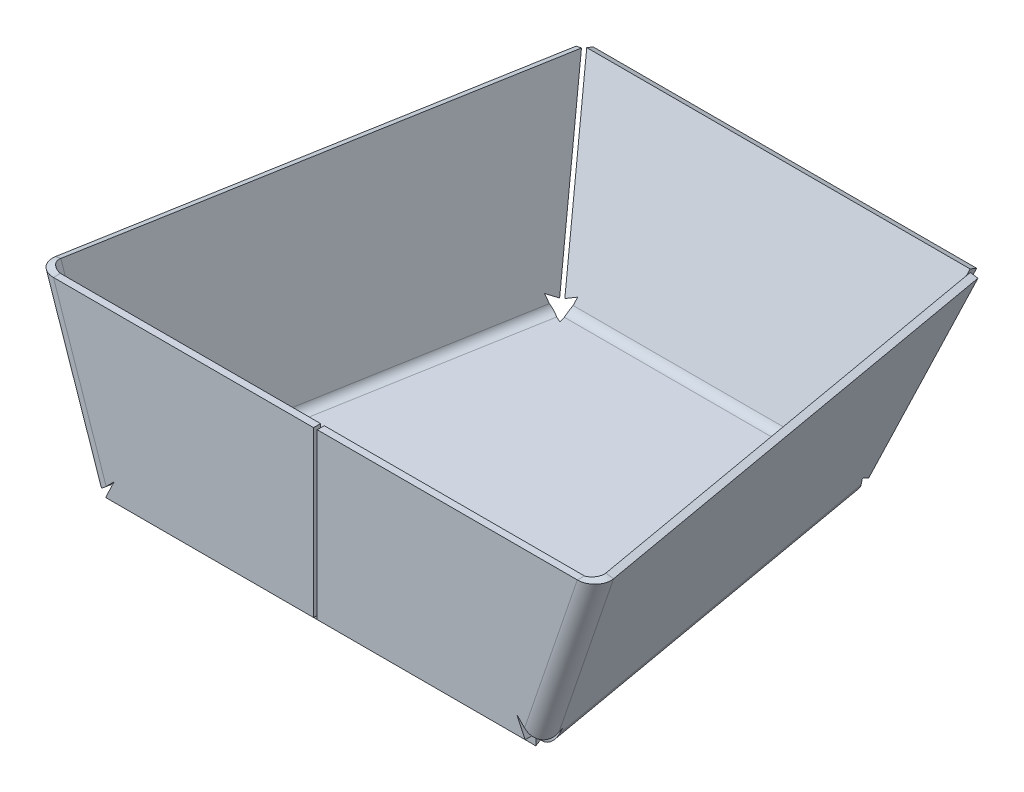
ISO-10303-21;
HEADER;
FILE_DESCRIPTION(('STEP AP214'),'2;1');
FILE_NAME('part.step','',(''),(''),'','','');
FILE_SCHEMA(('AUTOMOTIVE_DESIGN { 1 0 10303 214 1 1 1 1 }'));
ENDSEC;
DATA;
#1=APPLICATION_CONTEXT('core data for automotive mechanical design processes');
#2=APPLICATION_PROTOCOL_DEFINITION('international standard','automotive_design',2000,#1);
#3=PRODUCT_CONTEXT('',#1,'mechanical');
#4=PRODUCT('Part','Part','',(#3));
#5=PRODUCT_RELATED_PRODUCT_CATEGORY('part','',(#4));
#6=PRODUCT_DEFINITION_FORMATION('','',#4);
#7=PRODUCT_DEFINITION_CONTEXT('part definition',#1,'design');
#8=PRODUCT_DEFINITION('design','',#6,#7);
#9=PRODUCT_DEFINITION_SHAPE('','',#8);
#10=(LENGTH_UNIT() NAMED_UNIT(*) SI_UNIT(.MILLI.,.METRE.));
#11=(NAMED_UNIT(*) PLANE_ANGLE_UNIT() SI_UNIT($,.RADIAN.));
#12=(NAMED_UNIT(*) SI_UNIT($,.STERADIAN.) SOLID_ANGLE_UNIT());
#13=UNCERTAINTY_MEASURE_WITH_UNIT(LENGTH_MEASURE(1.E-05),#10,'distance_accuracy_value','');
#14=(GEOMETRIC_REPRESENTATION_CONTEXT(3) GLOBAL_UNCERTAINTY_ASSIGNED_CONTEXT((#13)) GLOBAL_UNIT_ASSIGNED_CONTEXT((#10,
#11,#12)) REPRESENTATION_CONTEXT('',''));
#15=CARTESIAN_POINT('',(0.,0.,0.));
#16=DIRECTION('',(0.,0.,1.));
#17=DIRECTION('',(1.,0.,0.));
#18=AXIS2_PLACEMENT_3D('',#15,#16,#17);
#19=CARTESIAN_POINT('',(-73.7034271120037,47.6969790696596,-4.85582251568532));
#20=CARTESIAN_POINT('',(-66.6627771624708,47.6969790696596,-44.7528388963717));
#21=CARTESIAN_POINT('',(-59.6221272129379,47.6969790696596,-84.6498552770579));
#22=CARTESIAN_POINT('',(-52.581477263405,47.6969790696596,-124.546871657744));
#23=CARTESIAN_POINT('',(-75.4746942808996,47.0928603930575,-5.16839907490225));
#24=CARTESIAN_POINT('',(-68.4340443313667,47.0928603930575,-45.0654154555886));
#25=CARTESIAN_POINT('',(-61.3933943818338,47.0928603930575,-84.9624318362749));
#26=CARTESIAN_POINT('',(-54.352744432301,47.0928603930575,-124.859448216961));
#27=B_SPLINE_SURFACE_WITH_KNOTS('',1,3,((#19,#20,#21,#22),(#23,#24,#25,#26)),.UNSPECIFIED.,.F.,
.F.,.F.,(2,2),(4,4),(0.,1.),(0.0406960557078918,0.983145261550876),.UNSPECIFIED.);
#28=CARTESIAN_POINT('',(-73.7034271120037,47.6969790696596,-4.85582251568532));
#29=CARTESIAN_POINT('',(-74.2938495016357,47.4956061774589,-4.96001470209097));
#30=CARTESIAN_POINT('',(-74.8842718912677,47.2942332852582,-5.06420688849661));
#31=CARTESIAN_POINT('',(-75.4746942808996,47.0928603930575,-5.16839907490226));
#32=(BOUNDED_CURVE() B_SPLINE_CURVE(3,(#28,#29,#30,#31),.UNSPECIFIED.,.F.,
.F.) B_SPLINE_CURVE_WITH_KNOTS((4,4),(0.,1.),
.UNSPECIFIED.) CURVE() GEOMETRIC_REPRESENTATION_ITEM() RATIONAL_B_SPLINE_CURVE((0.858559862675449,
0.858559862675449,0.858559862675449,0.858559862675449)) REPRESENTATION_ITEM(''));
#33=CARTESIAN_POINT('',(-73.7034271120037,47.6969790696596,-4.85582251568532));
#34=VERTEX_POINT('',#33);
#35=CARTESIAN_POINT('',(-75.4746942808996,47.0928603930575,-5.16839907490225));
#36=VERTEX_POINT('',#35);
#37=EDGE_CURVE('E12',#34,#36,#32,.T.);
#38=CARTESIAN_POINT('',(-73.7034271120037,47.6969790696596,-4.85582251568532));
#39=CARTESIAN_POINT('',(-66.6627771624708,47.6969790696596,-44.7528388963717));
#40=CARTESIAN_POINT('',(-59.6221272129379,47.6969790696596,-84.6498552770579));
#41=CARTESIAN_POINT('',(-52.581477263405,47.6969790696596,-124.546871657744));
#42=B_SPLINE_CURVE_WITH_KNOTS('',3,(#38,#39,#40,#41),.UNSPECIFIED.,.F.,.F.,(4,4),
(0.0406960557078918,0.983145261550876),.UNSPECIFIED.);
#43=CARTESIAN_POINT('',(-52.581477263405,47.6969790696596,-124.546871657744));
#44=VERTEX_POINT('',#43);
#45=EDGE_CURVE('E219',#44,#34,#42,.F.);
#46=CARTESIAN_POINT('',(-52.581477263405,47.6969790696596,-124.546871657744));
#47=CARTESIAN_POINT('',(-54.352744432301,47.0928603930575,-124.859448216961));
#48=B_SPLINE_CURVE_WITH_KNOTS('',1,(#46,#47),.UNSPECIFIED.,.F.,.F.,(2,2),(0.,1.),.UNSPECIFIED.);
#49=CARTESIAN_POINT('',(-54.352744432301,47.0928603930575,-124.859448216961));
#50=VERTEX_POINT('',#49);
#51=EDGE_CURVE('E58',#44,#50,#48,.T.);
#52=DIRECTION('',(-0.173785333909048,0.,0.984783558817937));
#53=VECTOR('',#52,1.);
#54=CARTESIAN_POINT('',(-53.975,47.0928603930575,-127.));
#55=LINE('',#54,#53);
#56=EDGE_CURVE('E223',#50,#36,#55,.T.);
#57=ORIENTED_EDGE('',*,*,#37,.F.);
#58=ORIENTED_EDGE('',*,*,#45,.F.);
#59=ORIENTED_EDGE('',*,*,#51,.T.);
#60=ORIENTED_EDGE('',*,*,#56,.T.);
#61=EDGE_LOOP('',(#57,#58,#59,#60));
#62=FACE_BOUND('',#61,.T.);
#63=ADVANCED_FACE('F44',(#62),#27,.F.);
#64=CARTESIAN_POINT('',(-29.8664552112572,-43.7047301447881,-88.1300143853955));
#65=DIRECTION('',(-0.263992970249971,0.299666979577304,0.916791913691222));
#66=DIRECTION('',(0.242535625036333,-0.899346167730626,0.3638034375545));
#67=AXIS2_PLACEMENT_3D('',#64,#65,#66);
#68=PLANE('',#67);
#69=ORIENTED_EDGE('',*,*,#51,.F.);
#70=DIRECTION('',(0.242535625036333,-0.899346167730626,0.3638034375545));
#71=VECTOR('',#70,1.);
#72=CARTESIAN_POINT('',(-28.0951880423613,-43.100611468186,-87.8174378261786));
#73=LINE('',#72,#71);
#74=CARTESIAN_POINT('',(-40.769545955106,3.89716552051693,-106.828974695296));
#75=VERTEX_POINT('',#74);
#76=EDGE_CURVE('E256',#44,#75,#73,.T.);
#77=ORIENTED_EDGE('',*,*,#76,.T.);
#78=DIRECTION('',(-0.933533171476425,-0.318396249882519,-0.164741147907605));
#79=VECTOR('',#78,1.);
#80=CARTESIAN_POINT('',(-42.5408131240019,3.29304684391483,-107.141551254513));
#81=LINE('',#80,#79);
#82=CARTESIAN_POINT('',(-42.5408131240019,3.29304684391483,-107.141551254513));
#83=VERTEX_POINT('',#82);
#84=EDGE_CURVE('E671',#75,#83,#81,.T.);
#85=ORIENTED_EDGE('',*,*,#84,.T.);
#86=DIRECTION('',(0.242535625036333,-0.899346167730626,0.3638034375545));
#87=VECTOR('',#86,1.);
#88=CARTESIAN_POINT('',(-29.8664552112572,-43.7047301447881,-88.1300143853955));
#89=LINE('',#88,#87);
#90=EDGE_CURVE('E674',#50,#83,#89,.T.);
#91=ORIENTED_EDGE('',*,*,#90,.F.);
#92=EDGE_LOOP('',(#69,#77,#85,#91));
#93=FACE_BOUND('',#92,.T.);
#94=ADVANCED_FACE('F668',(#93),#68,.F.);
#95=CARTESIAN_POINT('',(-64.6400790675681,39.6193748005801,-52.1204994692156));
#96=DIRECTION('',(-0.165871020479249,0.791020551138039,-0.5888745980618));
#97=DIRECTION('',(-0.317809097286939,0.52240818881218,0.791256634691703));
#98=AXIS2_PLACEMENT_3D('',#95,#96,#97);
#99=PLANE('',#98);
#100=ORIENTED_EDGE('',*,*,#84,.F.);
#101=DIRECTION('',(-0.317809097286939,0.52240818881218,0.791256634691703));
#102=VECTOR('',#101,1.);
#103=CARTESIAN_POINT('',(-62.8688118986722,40.2234934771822,-51.8079229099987));
#104=LINE('',#103,#102);
#105=CARTESIAN_POINT('',(-41.9381606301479,5.8181107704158,-103.919447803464));
#106=VERTEX_POINT('',#105);
#107=EDGE_CURVE('E573',#75,#106,#104,.T.);
#108=ORIENTED_EDGE('',*,*,#107,.T.);
#109=DIRECTION('',(-0.933533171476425,-0.318396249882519,-0.164741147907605));
#110=VECTOR('',#109,1.);
#111=CARTESIAN_POINT('',(-43.7094277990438,5.2139920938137,-104.232024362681));
#112=LINE('',#111,#110);
#113=CARTESIAN_POINT('',(-43.7094277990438,5.2139920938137,-104.232024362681));
#114=VERTEX_POINT('',#113);
#115=EDGE_CURVE('E2076',#106,#114,#112,.T.);
#116=ORIENTED_EDGE('',*,*,#115,.T.);
#117=DIRECTION('',(-0.317809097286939,0.52240818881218,0.791256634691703));
#118=VECTOR('',#117,1.);
#119=CARTESIAN_POINT('',(-64.6400790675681,39.6193748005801,-52.1204994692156));
#120=LINE('',#119,#118);
#121=EDGE_CURVE('E1049',#83,#114,#120,.T.);
#122=ORIENTED_EDGE('',*,*,#121,.F.);
#123=EDGE_LOOP('',(#100,#108,#116,#122));
#124=FACE_BOUND('',#123,.T.);
#125=ADVANCED_FACE('F691',(#124),#99,.F.);
#126=CARTESIAN_POINT('',(-43.9998596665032,5.97924751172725,-104.065257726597));
#127=DIRECTION('',(-0.087356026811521,-0.243649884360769,0.965921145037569));
#128=DIRECTION('',(0.347684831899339,-0.91611056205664,-0.199641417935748));
#129=AXIS2_PLACEMENT_3D('',#126,#127,#128);
#130=PLANE('',#129);
#131=ORIENTED_EDGE('',*,*,#115,.F.);
#132=DIRECTION('',(0.347684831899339,-0.91611056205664,-0.199641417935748));
#133=VECTOR('',#132,1.);
#134=CARTESIAN_POINT('',(-42.2285924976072,6.58336618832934,-103.75268116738));
#135=LINE('',#134,#133);
#136=CARTESIAN_POINT('',(-41.1072117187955,3.6286535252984,-104.39658055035));
#137=VERTEX_POINT('',#136);
#138=EDGE_CURVE('E2080',#106,#137,#135,.T.);
#139=ORIENTED_EDGE('',*,*,#138,.T.);
#140=DIRECTION('',(-0.933533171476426,-0.318396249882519,-0.164741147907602));
#141=VECTOR('',#140,1.);
#142=CARTESIAN_POINT('',(-42.8784788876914,3.02453484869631,-104.709157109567));
#143=LINE('',#142,#141);
#144=CARTESIAN_POINT('',(-42.8784788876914,3.02453484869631,-104.709157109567));
#145=VERTEX_POINT('',#144);
#146=EDGE_CURVE('E2074',#137,#145,#143,.T.);
#147=ORIENTED_EDGE('',*,*,#146,.T.);
#148=DIRECTION('',(0.347684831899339,-0.91611056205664,-0.199641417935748));
#149=VECTOR('',#148,1.);
#150=CARTESIAN_POINT('',(-43.9998596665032,5.97924751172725,-104.065257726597));
#151=LINE('',#150,#149);
#152=EDGE_CURVE('E1272',#114,#145,#151,.T.);
#153=ORIENTED_EDGE('',*,*,#152,.F.);
#154=EDGE_LOOP('',(#131,#139,#147,#153));
#155=FACE_BOUND('',#154,.T.);
#156=ADVANCED_FACE('F1691',(#155),#130,.F.);
#157=CARTESIAN_POINT('',(-36.8385301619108,8.05779470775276,-99.9669261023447));
#158=CARTESIAN_POINT('',(-37.1986583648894,7.54177681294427,-100.030478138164));
#159=CARTESIAN_POINT('',(-37.5587865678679,7.02575891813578,-100.094030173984));
#160=CARTESIAN_POINT('',(-37.9189147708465,6.50974102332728,-100.157582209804));
#161=CARTESIAN_POINT('',(-43.9691799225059,13.1892423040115,-101.225276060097));
#162=CARTESIAN_POINT('',(-43.312976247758,11.9418389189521,-101.109475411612));
#163=CARTESIAN_POINT('',(-42.6567725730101,10.6944355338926,-100.993674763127));
#164=CARTESIAN_POINT('',(-42.0005688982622,9.44703214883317,-100.877874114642));
#165=CARTESIAN_POINT('',(-48.3265132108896,5.94841288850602,-106.061227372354));
#166=CARTESIAN_POINT('',(-46.9500531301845,5.73304529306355,-105.818322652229));
#167=CARTESIAN_POINT('',(-45.5735930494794,5.51767769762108,-105.575417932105));
#168=CARTESIAN_POINT('',(-44.1971329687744,5.3023101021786,-105.33251321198));
#169=CARTESIAN_POINT('',(-41.1958634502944,0.816965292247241,-104.802877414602));
#170=CARTESIAN_POINT('',(-40.8357352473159,1.33298318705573,-104.739325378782));
#171=CARTESIAN_POINT('',(-40.4756070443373,1.84900108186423,-104.675773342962));
#172=CARTESIAN_POINT('',(-40.1154788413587,2.36501897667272,-104.612221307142));
#173=CARTESIAN_POINT('',(-34.0652136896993,-4.31448230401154,-103.54452745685));
#174=CARTESIAN_POINT('',(-34.7214173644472,-3.06707891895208,-103.660328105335));
#175=CARTESIAN_POINT('',(-35.3776210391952,-1.81967553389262,-103.776128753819));
#176=CARTESIAN_POINT('',(-36.0338247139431,-0.572272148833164,-103.891929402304));
#177=CARTESIAN_POINT('',(-29.7078804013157,2.92634711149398,-98.7085761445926));
#178=CARTESIAN_POINT('',(-31.0843404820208,3.14171470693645,-98.9514808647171));
#179=CARTESIAN_POINT('',(-32.4608005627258,3.35708230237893,-99.1943855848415));
#180=CARTESIAN_POINT('',(-33.8372606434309,3.5724498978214,-99.4372903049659));
#181=CARTESIAN_POINT('',(-36.8385301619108,8.05779470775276,-99.9669261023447));
#182=CARTESIAN_POINT('',(-37.1986583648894,7.54177681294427,-100.030478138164));
#183=CARTESIAN_POINT('',(-37.5587865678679,7.02575891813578,-100.094030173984));
#184=CARTESIAN_POINT('',(-37.9189147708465,6.50974102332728,-100.157582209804));
#185=(BOUNDED_SURFACE() B_SPLINE_SURFACE(3,3,((#157,#158,#159,#160),(#161,#162,#163,#164),(#165,
#166,#167,#168),(#169,#170,#171,#172),(#173,#174,#175,#176),(#177,#178,#179,#180),(#181,#182,
#183,#184)),.UNSPECIFIED.,.T.,.F.,.F.) B_SPLINE_SURFACE_WITH_KNOTS((4,3,4),(4,4),(0.,0.5,1.),
(0.,1.),.UNSPECIFIED.) GEOMETRIC_REPRESENTATION_ITEM() RATIONAL_B_SPLINE_SURFACE(((1.,1.,1.,1.),
(0.333333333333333,0.333333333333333,0.333333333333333,0.333333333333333),(0.333333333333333,
0.333333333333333,0.333333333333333,0.333333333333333),(1.,1.,1.,1.),(0.333333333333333,
0.333333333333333,0.333333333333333,0.333333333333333),(0.333333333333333,0.333333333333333,
0.333333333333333,0.333333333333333),(1.,1.,1.,1.))) REPRESENTATION_ITEM('') SURFACE());
#186=CARTESIAN_POINT('',(-39.0171968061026,4.43738,-102.384901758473));
#187=DIRECTION('',(0.489009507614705,0.505141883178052,-0.711126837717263));
#188=DIRECTION('',(0.33955451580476,0.640709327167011,0.688617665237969));
#189=AXIS2_PLACEMENT_3D('',#186,#187,#188);
#190=ELLIPSE('',#189,3.23447924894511,2.54);
#191=CARTESIAN_POINT('',(-38.7332539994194,1.89738,-103.993910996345));
#192=VERTEX_POINT('',#191);
#193=EDGE_CURVE('E895',#137,#192,#190,.F.);
#194=DIRECTION('',(0.,-1.,0.));
#195=VECTOR('',#194,1.);
#196=CARTESIAN_POINT('',(-38.7332539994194,0.,-103.993910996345));
#197=LINE('',#196,#195);
#198=CARTESIAN_POINT('',(-38.7332539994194,0.,-103.993910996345));
#199=VERTEX_POINT('',#198);
#200=EDGE_CURVE('E2072',#192,#199,#197,.T.);
#201=CARTESIAN_POINT('',(-39.0171968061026,4.43738,-102.384901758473));
#202=DIRECTION('',(0.392625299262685,0.335612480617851,-0.856276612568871));
#203=DIRECTION('',(0.447518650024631,0.743667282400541,0.496674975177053));
#204=AXIS2_PLACEMENT_3D('',#201,#202,#203);
#205=ELLIPSE('',#204,4.8683259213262,4.43738);
#206=EDGE_CURVE('E1118',#145,#199,#205,.F.);
#207=ORIENTED_EDGE('',*,*,#146,.F.);
#208=ORIENTED_EDGE('',*,*,#193,.T.);
#209=ORIENTED_EDGE('',*,*,#200,.T.);
#210=ORIENTED_EDGE('',*,*,#206,.F.);
#211=EDGE_LOOP('',(#207,#208,#209,#210));
#212=FACE_BOUND('',#211,.T.);
#213=ADVANCED_FACE('F1683',(#212),#185,.F.);
#214=CARTESIAN_POINT('',(32.671376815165,0.,-71.2530138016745));
#215=DIRECTION('',(-0.416799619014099,0.,0.908998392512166));
#216=DIRECTION('',(0.908998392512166,0.,0.416799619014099));
#217=AXIS2_PLACEMENT_3D('',#214,#215,#216);
#218=PLANE('',#217);
#219=ORIENTED_EDGE('',*,*,#200,.F.);
#220=DIRECTION('',(0.908998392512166,0.,0.416799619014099));
#221=VECTOR('',#220,1.);
#222=CARTESIAN_POINT('',(32.671376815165,1.89738,-71.2530138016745));
#223=LINE('',#222,#221);
#224=CARTESIAN_POINT('',(-37.1987150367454,1.89738,-103.290284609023));
#225=VERTEX_POINT('',#224);
#226=EDGE_CURVE('E2090',#192,#225,#223,.T.);
#227=ORIENTED_EDGE('',*,*,#226,.T.);
#228=DIRECTION('',(0.,-1.,0.));
#229=VECTOR('',#228,1.);
#230=CARTESIAN_POINT('',(-37.1987150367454,0.,-103.290284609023));
#231=LINE('',#230,#229);
#232=CARTESIAN_POINT('',(-37.1987150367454,0.,-103.290284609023));
#233=VERTEX_POINT('',#232);
#234=EDGE_CURVE('E2070',#225,#233,#231,.T.);
#235=ORIENTED_EDGE('',*,*,#234,.T.);
#236=DIRECTION('',(0.908998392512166,0.,0.416799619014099));
#237=VECTOR('',#236,1.);
#238=CARTESIAN_POINT('',(32.671376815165,0.,-71.2530138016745));
#239=LINE('',#238,#237);
#240=EDGE_CURVE('E1014',#199,#233,#239,.T.);
#241=ORIENTED_EDGE('',*,*,#240,.F.);
#242=EDGE_LOOP('',(#219,#227,#235,#241));
#243=FACE_BOUND('',#242,.T.);
#244=ADVANCED_FACE('F1690',(#243),#218,.F.);
#245=CARTESIAN_POINT('',(-9.95707312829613,0.,2.5624931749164));
#246=DIRECTION('',(0.968443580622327,0.,-0.249232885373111));
#247=DIRECTION('',(-0.249232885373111,0.,-0.968443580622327));
#248=AXIS2_PLACEMENT_3D('',#245,#246,#247);
#249=PLANE('',#248);
#250=ORIENTED_EDGE('',*,*,#234,.F.);
#251=DIRECTION('',(-0.249232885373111,0.,-0.968443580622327));
#252=VECTOR('',#251,1.);
#253=CARTESIAN_POINT('',(-9.95707312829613,1.89738,2.5624931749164));
#254=LINE('',#253,#252);
#255=CARTESIAN_POINT('',(-37.6279904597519,1.89738,-104.958319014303));
#256=VERTEX_POINT('',#255);
#257=EDGE_CURVE('E863',#225,#256,#254,.T.);
#258=ORIENTED_EDGE('',*,*,#257,.T.);
#259=DIRECTION('',(0.,-1.,0.));
#260=VECTOR('',#259,1.);
#261=CARTESIAN_POINT('',(-37.627990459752,0.,-104.958319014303));
#262=LINE('',#261,#260);
#263=CARTESIAN_POINT('',(-37.627990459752,0.,-104.958319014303));
#264=VERTEX_POINT('',#263);
#265=EDGE_CURVE('E2068',#256,#264,#262,.T.);
#266=ORIENTED_EDGE('',*,*,#265,.T.);
#267=DIRECTION('',(-0.249232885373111,0.,-0.968443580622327));
#268=VECTOR('',#267,1.);
#269=CARTESIAN_POINT('',(-9.95707312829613,0.,2.5624931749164));
#270=LINE('',#269,#268);
#271=EDGE_CURVE('E1019',#233,#264,#270,.T.);
#272=ORIENTED_EDGE('',*,*,#271,.F.);
#273=EDGE_LOOP('',(#250,#258,#266,#272));
#274=FACE_BOUND('',#273,.T.);
#275=ADVANCED_FACE('F1674',(#274),#249,.F.);
#276=CARTESIAN_POINT('',(-37.9742562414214,0.747242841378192,-107.422711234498));
#277=CARTESIAN_POINT('',(-37.9742562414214,1.27319828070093,-107.071461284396));
#278=CARTESIAN_POINT('',(-37.9742562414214,1.79915372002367,-106.720211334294));
#279=CARTESIAN_POINT('',(-37.9742562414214,2.32510915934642,-106.368961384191));
#280=CARTESIAN_POINT('',(-37.9742562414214,5.67602728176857,-114.802985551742));
#281=CARTESIAN_POINT('',(-37.9742562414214,5.49948282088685,-113.399824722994));
#282=CARTESIAN_POINT('',(-37.9742562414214,5.32293836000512,-111.996663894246));
#283=CARTESIAN_POINT('',(-37.9742562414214,5.14639389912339,-110.593503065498));
#284=CARTESIAN_POINT('',(-33.8617702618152,13.0563015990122,-109.874201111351));
#285=CARTESIAN_POINT('',(-33.8617702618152,11.827846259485,-109.173540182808));
#286=CARTESIAN_POINT('',(-33.8617702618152,10.5993909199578,-108.472879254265));
#287=CARTESIAN_POINT('',(-33.8617702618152,9.37093558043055,-107.772218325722));
#288=CARTESIAN_POINT('',(-33.8617702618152,8.1275171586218,-102.493926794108));
#289=CARTESIAN_POINT('',(-33.8617702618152,7.60156171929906,-102.84517674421));
#290=CARTESIAN_POINT('',(-33.8617702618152,7.07560627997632,-103.196426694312));
#291=CARTESIAN_POINT('',(-33.8617702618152,6.54965084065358,-103.547676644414));
#292=CARTESIAN_POINT('',(-33.8617702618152,3.19873271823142,-95.1136524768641));
#293=CARTESIAN_POINT('',(-33.8617702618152,3.37527717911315,-96.5168133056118));
#294=CARTESIAN_POINT('',(-33.8617702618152,3.55182163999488,-97.9199741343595));
#295=CARTESIAN_POINT('',(-33.8617702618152,3.7283661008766,-99.3231349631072));
#296=CARTESIAN_POINT('',(-37.9742562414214,-4.18154159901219,-100.042436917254));
#297=CARTESIAN_POINT('',(-37.9742562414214,-2.95308625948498,-100.743097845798));
#298=CARTESIAN_POINT('',(-37.9742562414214,-1.72463091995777,-101.443758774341));
#299=CARTESIAN_POINT('',(-37.9742562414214,-0.496175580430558,-102.144419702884));
#300=CARTESIAN_POINT('',(-37.9742562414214,0.747242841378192,-107.422711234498));
#301=CARTESIAN_POINT('',(-37.9742562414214,1.27319828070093,-107.071461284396));
#302=CARTESIAN_POINT('',(-37.9742562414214,1.79915372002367,-106.720211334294));
#303=CARTESIAN_POINT('',(-37.9742562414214,2.32510915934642,-106.368961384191));
#304=(BOUNDED_SURFACE() B_SPLINE_SURFACE(3,3,((#276,#277,#278,#279),(#280,#281,#282,#283),(#284,
#285,#286,#287),(#288,#289,#290,#291),(#292,#293,#294,#295),(#296,#297,#298,#299),(#300,#301,
#302,#303)),.UNSPECIFIED.,.T.,.F.,.F.) B_SPLINE_SURFACE_WITH_KNOTS((4,3,4),(4,4),(0.,0.5,1.),
(0.,1.),.UNSPECIFIED.) GEOMETRIC_REPRESENTATION_ITEM() RATIONAL_B_SPLINE_SURFACE(((1.,1.,1.,1.),
(0.333333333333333,0.333333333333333,0.333333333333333,0.333333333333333),(0.333333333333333,
0.333333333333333,0.333333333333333,0.333333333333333),(1.,1.,1.,1.),(0.333333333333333,
0.333333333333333,0.333333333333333,0.333333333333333),(0.333333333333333,0.333333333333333,
0.333333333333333,0.333333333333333),(1.,1.,1.,1.))) REPRESENTATION_ITEM('') SURFACE());
#305=CARTESIAN_POINT('',(-35.9180132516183,4.43738,-104.958319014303));
#306=DIRECTION('',(-0.777237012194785,0.523251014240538,0.349443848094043));
#307=DIRECTION('',(-0.629207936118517,-0.646352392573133,-0.431654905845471));
#308=AXIS2_PLACEMENT_3D('',#305,#306,#307);
#309=ELLIPSE('',#308,3.26798641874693,2.54);
#310=CARTESIAN_POINT('',(-37.6178964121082,3.48488,-107.312962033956));
#311=VERTEX_POINT('',#310);
#312=EDGE_CURVE('E270',#256,#311,#309,.F.);
#313=DIRECTION('',(0.,-0.375,-0.927024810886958));
#314=VECTOR('',#313,1.);
#315=CARTESIAN_POINT('',(-37.6178964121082,2.7733625,-109.071880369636));
#316=LINE('',#315,#314);
#317=CARTESIAN_POINT('',(-37.6178964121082,2.7733625,-109.071880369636));
#318=VERTEX_POINT('',#317);
#319=EDGE_CURVE('E2066',#311,#318,#316,.T.);
#320=CARTESIAN_POINT('',(-35.9180132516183,4.43738,-104.958319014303));
#321=DIRECTION('',(-0.907318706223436,0.349641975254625,0.233502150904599));
#322=DIRECTION('',(-0.420443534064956,-0.754528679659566,-0.503898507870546));
#323=AXIS2_PLACEMENT_3D('',#320,#321,#322);
#324=ELLIPSE('',#323,4.89065195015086,4.43738);
#325=EDGE_CURVE('E1116',#264,#318,#324,.F.);
#326=ORIENTED_EDGE('',*,*,#265,.F.);
#327=ORIENTED_EDGE('',*,*,#312,.T.);
#328=ORIENTED_EDGE('',*,*,#319,.T.);
#329=ORIENTED_EDGE('',*,*,#325,.F.);
#330=EDGE_LOOP('',(#326,#327,#328,#329));
#331=FACE_BOUND('',#330,.T.);
#332=ADVANCED_FACE('F1666',(#331),#304,.F.);
#333=CARTESIAN_POINT('',(-45.8365796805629,-26.4483569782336,-97.2511128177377));
#334=DIRECTION('',(0.967650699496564,-0.233882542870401,0.0946101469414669));
#335=DIRECTION('',(0.252293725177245,0.897036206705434,-0.362869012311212));
#336=AXIS2_PLACEMENT_3D('',#333,#334,#335);
#337=PLANE('',#336);
#338=ORIENTED_EDGE('',*,*,#319,.F.);
#339=DIRECTION('',(0.252293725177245,0.897036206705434,-0.362869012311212));
#340=VECTOR('',#339,1.);
#341=CARTESIAN_POINT('',(-45.8365796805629,-25.7368394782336,-95.492194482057));
#342=LINE('',#341,#340);
#343=CARTESIAN_POINT('',(-37.0983005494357,5.3323151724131,-108.060286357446));
#344=VERTEX_POINT('',#343);
#345=EDGE_CURVE('E2086',#311,#344,#342,.T.);
#346=ORIENTED_EDGE('',*,*,#345,.T.);
#347=DIRECTION('',(0.,-0.375,-0.927024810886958));
#348=VECTOR('',#347,1.);
#349=CARTESIAN_POINT('',(-37.0983005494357,4.6207976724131,-109.819204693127));
#350=LINE('',#349,#348);
#351=CARTESIAN_POINT('',(-37.0983005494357,4.6207976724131,-109.819204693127));
#352=VERTEX_POINT('',#351);
#353=EDGE_CURVE('E2064',#344,#352,#350,.T.);
#354=ORIENTED_EDGE('',*,*,#353,.T.);
#355=DIRECTION('',(0.252293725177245,0.897036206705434,-0.362869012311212));
#356=VECTOR('',#355,1.);
#357=CARTESIAN_POINT('',(-45.8365796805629,-26.4483569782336,-97.2511128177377));
#358=LINE('',#357,#356);
#359=EDGE_CURVE('E1018',#318,#352,#358,.T.);
#360=ORIENTED_EDGE('',*,*,#359,.F.);
#361=EDGE_LOOP('',(#338,#346,#354,#360));
#362=FACE_BOUND('',#361,.T.);
#363=ADVANCED_FACE('F1673',(#362),#337,.F.);
#364=CARTESIAN_POINT('',(-27.951048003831,9.31178950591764,-111.716804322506));
#365=DIRECTION('',(-0.484067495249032,0.811175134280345,-0.328136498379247));
#366=DIRECTION('',(-0.875030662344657,-0.448742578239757,0.181525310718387));
#367=AXIS2_PLACEMENT_3D('',#364,#365,#366);
#368=PLANE('',#367);
#369=ORIENTED_EDGE('',*,*,#353,.F.);
#370=DIRECTION('',(-0.875030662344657,-0.448742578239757,0.181525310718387));
#371=VECTOR('',#370,1.);
#372=CARTESIAN_POINT('',(-27.951048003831,10.0233070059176,-109.957885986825));
#373=LINE('',#372,#371);
#374=CARTESIAN_POINT('',(-39.9949069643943,3.84684650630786,-107.459384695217));
#375=VERTEX_POINT('',#374);
#376=EDGE_CURVE('E604',#344,#375,#373,.T.);
#377=ORIENTED_EDGE('',*,*,#376,.T.);
#378=DIRECTION('',(0.,-0.375,-0.927024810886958));
#379=VECTOR('',#378,1.);
#380=CARTESIAN_POINT('',(-39.9949069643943,3.13532900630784,-109.218303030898));
#381=LINE('',#380,#379);
#382=CARTESIAN_POINT('',(-39.9949069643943,3.13532900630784,-109.218303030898));
#383=VERTEX_POINT('',#382);
#384=EDGE_CURVE('E2051',#375,#383,#381,.T.);
#385=ORIENTED_EDGE('',*,*,#384,.T.);
#386=DIRECTION('',(-0.875030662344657,-0.448742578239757,0.181525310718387));
#387=VECTOR('',#386,1.);
#388=CARTESIAN_POINT('',(-27.951048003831,9.31178950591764,-111.716804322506));
#389=LINE('',#388,#387);
#390=EDGE_CURVE('E1031',#352,#383,#389,.T.);
#391=ORIENTED_EDGE('',*,*,#390,.F.);
#392=EDGE_LOOP('',(#369,#377,#385,#391));
#393=FACE_BOUND('',#392,.T.);
#394=ADVANCED_FACE('F1750',(#393),#368,.F.);
#395=CARTESIAN_POINT('',(-27.3214673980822,-43.859042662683,-90.2081436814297));
#396=DIRECTION('',(0.970142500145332,0.224836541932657,-0.0909508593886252));
#397=DIRECTION('',(-0.242535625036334,0.899346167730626,-0.3638034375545));
#398=AXIS2_PLACEMENT_3D('',#395,#396,#397);
#399=PLANE('',#398);
#400=ORIENTED_EDGE('',*,*,#384,.F.);
#401=DIRECTION('',(-0.242535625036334,0.899346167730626,-0.3638034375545));
#402=VECTOR('',#401,1.);
#403=CARTESIAN_POINT('',(-27.3214673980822,-43.147525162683,-88.449225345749));
#404=LINE('',#403,#402);
#405=CARTESIAN_POINT('',(-51.8493716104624,47.8043778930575,-125.241081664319));
#406=VERTEX_POINT('',#405);
#407=EDGE_CURVE('E642',#375,#406,#404,.T.);
#408=ORIENTED_EDGE('',*,*,#407,.T.);
#409=CARTESIAN_POINT('',(-51.8493716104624,47.0928603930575,-127.));
#410=CARTESIAN_POINT('',(-51.8493716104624,47.8043778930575,-125.241081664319));
#411=B_SPLINE_CURVE_WITH_KNOTS('',1,(#409,#410),.UNSPECIFIED.,.F.,.F.,(2,2),(0.,1.),.UNSPECIFIED.);
#412=CARTESIAN_POINT('',(-51.8493716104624,47.0928603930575,-127.));
#413=VERTEX_POINT('',#412);
#414=EDGE_CURVE('E2047',#406,#413,#411,.F.);
#415=ORIENTED_EDGE('',*,*,#414,.T.);
#416=DIRECTION('',(-0.242535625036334,0.899346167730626,-0.3638034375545));
#417=VECTOR('',#416,1.);
#418=CARTESIAN_POINT('',(-27.3214673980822,-43.859042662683,-90.2081436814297));
#419=LINE('',#418,#417);
#420=EDGE_CURVE('E1026',#383,#413,#419,.T.);
#421=ORIENTED_EDGE('',*,*,#420,.F.);
#422=EDGE_LOOP('',(#400,#408,#415,#421));
#423=FACE_BOUND('',#422,.T.);
#424=ADVANCED_FACE('F1655',(#423),#399,.F.);
#425=CARTESIAN_POINT('',(-51.8493716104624,47.8043778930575,-125.241081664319));
#426=CARTESIAN_POINT('',(-17.2831238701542,47.8043778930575,-125.241081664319));
#427=CARTESIAN_POINT('',(17.2831238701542,47.8043778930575,-125.241081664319));
#428=CARTESIAN_POINT('',(51.8493716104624,47.8043778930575,-125.241081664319));
#429=CARTESIAN_POINT('',(-51.8493716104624,47.0928603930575,-127.));
#430=CARTESIAN_POINT('',(-17.2831238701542,47.0928603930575,-127.));
#431=CARTESIAN_POINT('',(17.2831238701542,47.0928603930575,-127.));
#432=CARTESIAN_POINT('',(51.8493716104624,47.0928603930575,-127.));
#433=B_SPLINE_SURFACE_WITH_KNOTS('',1,3,((#425,#426,#427,#428),(#429,#430,#431,#432)),
.UNSPECIFIED.,.F.,.F.,.F.,(2,2),(4,4),(0.,1.),(0.019690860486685,0.980309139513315),.UNSPECIFIED.);
#434=CARTESIAN_POINT('',(-51.8493716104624,47.8043778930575,-125.241081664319));
#435=CARTESIAN_POINT('',(-17.2831238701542,47.8043778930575,-125.241081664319));
#436=CARTESIAN_POINT('',(17.2831238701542,47.8043778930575,-125.241081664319));
#437=CARTESIAN_POINT('',(51.8493716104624,47.8043778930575,-125.241081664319));
#438=B_SPLINE_CURVE_WITH_KNOTS('',3,(#434,#435,#436,#437),.UNSPECIFIED.,.F.,.F.,(4,4),
(0.019690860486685,0.980309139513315),.UNSPECIFIED.);
#439=CARTESIAN_POINT('',(51.8493716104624,47.8043778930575,-125.241081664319));
#440=VERTEX_POINT('',#439);
#441=EDGE_CURVE('E258',#440,#406,#438,.F.);
#442=CARTESIAN_POINT('',(51.8493716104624,47.8043778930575,-125.241081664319));
#443=CARTESIAN_POINT('',(51.8493716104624,47.0928603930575,-127.));
#444=B_SPLINE_CURVE_WITH_KNOTS('',1,(#442,#443),.UNSPECIFIED.,.F.,.F.,(2,2),(0.,1.),.UNSPECIFIED.);
#445=CARTESIAN_POINT('',(51.8493716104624,47.0928603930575,-127.));
#446=VERTEX_POINT('',#445);
#447=EDGE_CURVE('E2010',#440,#446,#444,.T.);
#448=DIRECTION('',(-1.,0.,0.));
#449=VECTOR('',#448,1.);
#450=CARTESIAN_POINT('',(-53.975,47.0928603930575,-127.));
#451=LINE('',#450,#449);
#452=EDGE_CURVE('E436',#446,#413,#451,.T.);
#453=ORIENTED_EDGE('',*,*,#414,.F.);
#454=ORIENTED_EDGE('',*,*,#441,.F.);
#455=ORIENTED_EDGE('',*,*,#447,.T.);
#456=ORIENTED_EDGE('',*,*,#452,.T.);
#457=EDGE_LOOP('',(#453,#454,#455,#456));
#458=FACE_BOUND('',#457,.T.);
#459=ADVANCED_FACE('F1647',(#458),#433,.F.);
#460=CARTESIAN_POINT('',(27.3214673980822,-43.859042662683,-90.2081436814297));
#461=DIRECTION('',(-0.970142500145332,0.224836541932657,-0.090950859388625));
#462=DIRECTION('',(-0.242535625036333,-0.899346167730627,0.3638034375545));
#463=AXIS2_PLACEMENT_3D('',#460,#461,#462);
#464=PLANE('',#463);
#465=ORIENTED_EDGE('',*,*,#447,.F.);
#466=DIRECTION('',(-0.242535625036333,-0.899346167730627,0.3638034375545));
#467=VECTOR('',#466,1.);
#468=CARTESIAN_POINT('',(27.3214673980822,-43.147525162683,-88.449225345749));
#469=LINE('',#468,#467);
#470=CARTESIAN_POINT('',(39.9949069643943,3.84684650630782,-107.459384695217));
#471=VERTEX_POINT('',#470);
#472=EDGE_CURVE('E656',#440,#471,#469,.T.);
#473=ORIENTED_EDGE('',*,*,#472,.T.);
#474=DIRECTION('',(0.,-0.375,-0.927024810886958));
#475=VECTOR('',#474,1.);
#476=CARTESIAN_POINT('',(39.9949069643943,3.13532900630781,-109.218303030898));
#477=LINE('',#476,#475);
#478=CARTESIAN_POINT('',(39.9949069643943,3.13532900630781,-109.218303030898));
#479=VERTEX_POINT('',#478);
#480=EDGE_CURVE('E2008',#471,#479,#477,.T.);
#481=ORIENTED_EDGE('',*,*,#480,.T.);
#482=DIRECTION('',(-0.242535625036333,-0.899346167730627,0.3638034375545));
#483=VECTOR('',#482,1.);
#484=CARTESIAN_POINT('',(27.3214673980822,-43.859042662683,-90.2081436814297));
#485=LINE('',#484,#483);
#486=EDGE_CURVE('E1043',#446,#479,#485,.T.);
#487=ORIENTED_EDGE('',*,*,#486,.F.);
#488=EDGE_LOOP('',(#465,#473,#481,#487));
#489=FACE_BOUND('',#488,.T.);
#490=ADVANCED_FACE('F1654',(#489),#464,.F.);
#491=CARTESIAN_POINT('',(27.9510480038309,9.31178950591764,-111.716804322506));
#492=DIRECTION('',(0.484067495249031,0.811175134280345,-0.328136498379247));
#493=DIRECTION('',(-0.875030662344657,0.448742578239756,-0.181525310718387));
#494=AXIS2_PLACEMENT_3D('',#491,#492,#493);
#495=PLANE('',#494);
#496=ORIENTED_EDGE('',*,*,#480,.F.);
#497=DIRECTION('',(-0.875030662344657,0.448742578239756,-0.181525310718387));
#498=VECTOR('',#497,1.);
#499=CARTESIAN_POINT('',(27.9510480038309,10.0233070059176,-109.957885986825));
#500=LINE('',#499,#498);
#501=CARTESIAN_POINT('',(37.0983005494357,5.33231517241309,-108.060286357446));
#502=VERTEX_POINT('',#501);
#503=EDGE_CURVE('E586',#471,#502,#500,.T.);
#504=ORIENTED_EDGE('',*,*,#503,.T.);
#505=DIRECTION('',(0.,-0.375,-0.927024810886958));
#506=VECTOR('',#505,1.);
#507=CARTESIAN_POINT('',(37.0983005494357,4.62079767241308,-109.819204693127));
#508=LINE('',#507,#506);
#509=CARTESIAN_POINT('',(37.0983005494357,4.62079767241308,-109.819204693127));
#510=VERTEX_POINT('',#509);
#511=EDGE_CURVE('E2006',#502,#510,#508,.T.);
#512=ORIENTED_EDGE('',*,*,#511,.T.);
#513=DIRECTION('',(-0.875030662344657,0.448742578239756,-0.181525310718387));
#514=VECTOR('',#513,1.);
#515=CARTESIAN_POINT('',(27.9510480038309,9.31178950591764,-111.716804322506));
#516=LINE('',#515,#514);
#517=EDGE_CURVE('E1094',#479,#510,#516,.T.);
#518=ORIENTED_EDGE('',*,*,#517,.F.);
#519=EDGE_LOOP('',(#496,#504,#512,#518));
#520=FACE_BOUND('',#519,.T.);
#521=ADVANCED_FACE('F1768',(#520),#495,.F.);
#522=CARTESIAN_POINT('',(45.8365796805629,-26.4483569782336,-97.2511128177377));
#523=DIRECTION('',(-0.967650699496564,-0.233882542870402,0.094610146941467));
#524=DIRECTION('',(0.252293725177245,-0.897036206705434,0.362869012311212));
#525=AXIS2_PLACEMENT_3D('',#522,#523,#524);
#526=PLANE('',#525);
#527=ORIENTED_EDGE('',*,*,#511,.F.);
#528=DIRECTION('',(0.252293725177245,-0.897036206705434,0.362869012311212));
#529=VECTOR('',#528,1.);
#530=CARTESIAN_POINT('',(45.8365796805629,-25.7368394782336,-95.492194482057));
#531=LINE('',#530,#529);
#532=CARTESIAN_POINT('',(37.6178964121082,3.48488,-107.312962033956));
#533=VERTEX_POINT('',#532);
#534=EDGE_CURVE('E588',#502,#533,#531,.T.);
#535=ORIENTED_EDGE('',*,*,#534,.T.);
#536=DIRECTION('',(0.,-0.375000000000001,-0.927024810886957));
#537=VECTOR('',#536,1.);
#538=CARTESIAN_POINT('',(37.6178964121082,2.77336249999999,-109.071880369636));
#539=LINE('',#538,#537);
#540=CARTESIAN_POINT('',(37.6178964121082,2.77336249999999,-109.071880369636));
#541=VERTEX_POINT('',#540);
#542=EDGE_CURVE('E2004',#533,#541,#539,.T.);
#543=ORIENTED_EDGE('',*,*,#542,.T.);
#544=DIRECTION('',(0.252293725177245,-0.897036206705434,0.362869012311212));
#545=VECTOR('',#544,1.);
#546=CARTESIAN_POINT('',(45.8365796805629,-26.4483569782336,-97.2511128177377));
#547=LINE('',#546,#545);
#548=EDGE_CURVE('E1084',#510,#541,#547,.T.);
#549=ORIENTED_EDGE('',*,*,#548,.F.);
#550=EDGE_LOOP('',(#527,#535,#543,#549));
#551=FACE_BOUND('',#550,.T.);
#552=ADVANCED_FACE('F1638',(#551),#526,.F.);
#553=CARTESIAN_POINT('',(33.8617702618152,8.1275171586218,-102.493926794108));
#554=CARTESIAN_POINT('',(33.8617702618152,7.60156171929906,-102.84517674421));
#555=CARTESIAN_POINT('',(33.8617702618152,7.07560627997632,-103.196426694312));
#556=CARTESIAN_POINT('',(33.8617702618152,6.54965084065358,-103.547676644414));
#557=CARTESIAN_POINT('',(33.8617702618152,13.0563015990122,-109.874201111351));
#558=CARTESIAN_POINT('',(33.8617702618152,11.827846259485,-109.173540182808));
#559=CARTESIAN_POINT('',(33.8617702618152,10.5993909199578,-108.472879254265));
#560=CARTESIAN_POINT('',(33.8617702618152,9.37093558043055,-107.772218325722));
#561=CARTESIAN_POINT('',(37.9742562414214,5.67602728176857,-114.802985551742));
#562=CARTESIAN_POINT('',(37.9742562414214,5.49948282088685,-113.399824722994));
#563=CARTESIAN_POINT('',(37.9742562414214,5.32293836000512,-111.996663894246));
#564=CARTESIAN_POINT('',(37.9742562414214,5.14639389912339,-110.593503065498));
#565=CARTESIAN_POINT('',(37.9742562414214,0.747242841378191,-107.422711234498));
#566=CARTESIAN_POINT('',(37.9742562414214,1.27319828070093,-107.071461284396));
#567=CARTESIAN_POINT('',(37.9742562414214,1.79915372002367,-106.720211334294));
#568=CARTESIAN_POINT('',(37.9742562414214,2.32510915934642,-106.368961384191));
#569=CARTESIAN_POINT('',(37.9742562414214,-4.18154159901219,-100.042436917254));
#570=CARTESIAN_POINT('',(37.9742562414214,-2.95308625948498,-100.743097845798));
#571=CARTESIAN_POINT('',(37.9742562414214,-1.72463091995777,-101.443758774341));
#572=CARTESIAN_POINT('',(37.9742562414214,-0.496175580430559,-102.144419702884));
#573=CARTESIAN_POINT('',(33.8617702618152,3.19873271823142,-95.1136524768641));
#574=CARTESIAN_POINT('',(33.8617702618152,3.37527717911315,-96.5168133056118));
#575=CARTESIAN_POINT('',(33.8617702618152,3.55182163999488,-97.9199741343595));
#576=CARTESIAN_POINT('',(33.8617702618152,3.7283661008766,-99.3231349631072));
#577=CARTESIAN_POINT('',(33.8617702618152,8.1275171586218,-102.493926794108));
#578=CARTESIAN_POINT('',(33.8617702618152,7.60156171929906,-102.84517674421));
#579=CARTESIAN_POINT('',(33.8617702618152,7.07560627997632,-103.196426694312));
#580=CARTESIAN_POINT('',(33.8617702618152,6.54965084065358,-103.547676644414));
#581=(BOUNDED_SURFACE() B_SPLINE_SURFACE(3,3,((#553,#554,#555,#556),(#557,#558,#559,#560),(#561,
#562,#563,#564),(#565,#566,#567,#568),(#569,#570,#571,#572),(#573,#574,#575,#576),(#577,#578,
#579,#580)),.UNSPECIFIED.,.T.,.F.,.F.) B_SPLINE_SURFACE_WITH_KNOTS((4,3,4),(4,4),(0.,0.5,1.),
(0.,1.),.UNSPECIFIED.) GEOMETRIC_REPRESENTATION_ITEM() RATIONAL_B_SPLINE_SURFACE(((1.,1.,1.,1.),
(0.333333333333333,0.333333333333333,0.333333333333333,0.333333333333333),(0.333333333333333,
0.333333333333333,0.333333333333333,0.333333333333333),(1.,1.,1.,1.),(0.333333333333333,
0.333333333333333,0.333333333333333,0.333333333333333),(0.333333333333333,0.333333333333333,
0.333333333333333,0.333333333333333),(1.,1.,1.,1.))) REPRESENTATION_ITEM('') SURFACE());
#582=CARTESIAN_POINT('',(35.9180132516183,4.43738,-104.958319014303));
#583=DIRECTION('',(0.777237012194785,0.523251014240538,0.349443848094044));
#584=DIRECTION('',(-0.629207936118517,0.646352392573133,0.431654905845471));
#585=AXIS2_PLACEMENT_3D('',#582,#583,#584);
#586=ELLIPSE('',#585,3.26798641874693,2.54);
#587=CARTESIAN_POINT('',(37.6279904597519,1.89738,-104.958319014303));
#588=VERTEX_POINT('',#587);
#589=EDGE_CURVE('E265',#533,#588,#586,.F.);
#590=DIRECTION('',(0.,-1.,0.));
#591=VECTOR('',#590,1.);
#592=CARTESIAN_POINT('',(37.6279904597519,0.,-104.958319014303));
#593=LINE('',#592,#591);
#594=CARTESIAN_POINT('',(37.6279904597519,0.,-104.958319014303));
#595=VERTEX_POINT('',#594);
#596=EDGE_CURVE('E2002',#588,#595,#593,.T.);
#597=CARTESIAN_POINT('',(35.9180132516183,4.43738,-104.958319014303));
#598=DIRECTION('',(0.907318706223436,0.349641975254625,0.233502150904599));
#599=DIRECTION('',(-0.420443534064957,0.754528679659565,0.503898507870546));
#600=AXIS2_PLACEMENT_3D('',#597,#598,#599);
#601=ELLIPSE('',#600,4.89065195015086,4.43738);
#602=EDGE_CURVE('E1007',#541,#595,#601,.F.);
#603=ORIENTED_EDGE('',*,*,#542,.F.);
#604=ORIENTED_EDGE('',*,*,#589,.T.);
#605=ORIENTED_EDGE('',*,*,#596,.T.);
#606=ORIENTED_EDGE('',*,*,#602,.F.);
#607=EDGE_LOOP('',(#603,#604,#605,#606));
#608=FACE_BOUND('',#607,.T.);
#609=ADVANCED_FACE('F1630',(#608),#581,.F.);
#610=CARTESIAN_POINT('',(9.95707312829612,0.,2.5624931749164));
#611=DIRECTION('',(-0.968443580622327,0.,-0.249232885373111));
#612=DIRECTION('',(-0.249232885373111,0.,0.968443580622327));
#613=AXIS2_PLACEMENT_3D('',#610,#611,#612);
#614=PLANE('',#613);
#615=ORIENTED_EDGE('',*,*,#596,.F.);
#616=DIRECTION('',(-0.249232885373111,0.,0.968443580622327));
#617=VECTOR('',#616,1.);
#618=CARTESIAN_POINT('',(9.95707312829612,1.89738,2.5624931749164));
#619=LINE('',#618,#617);
#620=CARTESIAN_POINT('',(37.1987150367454,1.89738,-103.290284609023));
#621=VERTEX_POINT('',#620);
#622=EDGE_CURVE('E584',#588,#621,#619,.T.);
#623=ORIENTED_EDGE('',*,*,#622,.T.);
#624=DIRECTION('',(0.,-1.,0.));
#625=VECTOR('',#624,1.);
#626=CARTESIAN_POINT('',(37.1987150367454,0.,-103.290284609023));
#627=LINE('',#626,#625);
#628=CARTESIAN_POINT('',(37.1987150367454,0.,-103.290284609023));
#629=VERTEX_POINT('',#628);
#630=EDGE_CURVE('E1997',#621,#629,#627,.T.);
#631=ORIENTED_EDGE('',*,*,#630,.T.);
#632=DIRECTION('',(-0.249232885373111,0.,0.968443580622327));
#633=VECTOR('',#632,1.);
#634=CARTESIAN_POINT('',(9.95707312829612,0.,2.5624931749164));
#635=LINE('',#634,#633);
#636=EDGE_CURVE('E1098',#595,#629,#635,.T.);
#637=ORIENTED_EDGE('',*,*,#636,.F.);
#638=EDGE_LOOP('',(#615,#623,#631,#637));
#639=FACE_BOUND('',#638,.T.);
#640=ADVANCED_FACE('F1637',(#639),#614,.F.);
#641=CARTESIAN_POINT('',(-32.6713768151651,0.,-71.2530138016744));
#642=DIRECTION('',(0.4167996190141,0.,0.908998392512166));
#643=DIRECTION('',(0.908998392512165,0.,-0.4167996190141));
#644=AXIS2_PLACEMENT_3D('',#641,#642,#643);
#645=PLANE('',#644);
#646=ORIENTED_EDGE('',*,*,#630,.F.);
#647=DIRECTION('',(0.908998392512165,0.,-0.4167996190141));
#648=VECTOR('',#647,1.);
#649=CARTESIAN_POINT('',(-32.6713768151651,1.89738,-71.2530138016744));
#650=LINE('',#649,#648);
#651=CARTESIAN_POINT('',(38.7332539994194,1.89738,-103.993910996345));
#652=VERTEX_POINT('',#651);
#653=EDGE_CURVE('E576',#621,#652,#650,.T.);
#654=ORIENTED_EDGE('',*,*,#653,.T.);
#655=DIRECTION('',(0.,-1.,0.));
#656=VECTOR('',#655,1.);
#657=CARTESIAN_POINT('',(38.7332539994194,0.,-103.993910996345));
#658=LINE('',#657,#656);
#659=CARTESIAN_POINT('',(38.7332539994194,0.,-103.993910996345));
#660=VERTEX_POINT('',#659);
#661=EDGE_CURVE('E1995',#652,#660,#658,.T.);
#662=ORIENTED_EDGE('',*,*,#661,.T.);
#663=DIRECTION('',(0.908998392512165,0.,-0.4167996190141));
#664=VECTOR('',#663,1.);
#665=CARTESIAN_POINT('',(-32.6713768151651,0.,-71.2530138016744));
#666=LINE('',#665,#664);
#667=EDGE_CURVE('E1104',#629,#660,#666,.T.);
#668=ORIENTED_EDGE('',*,*,#667,.F.);
#669=EDGE_LOOP('',(#646,#654,#662,#668));
#670=FACE_BOUND('',#669,.T.);
#671=ADVANCED_FACE('F1621',(#670),#645,.F.);
#672=CARTESIAN_POINT('',(41.1958634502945,0.816965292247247,-104.802877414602));
#673=CARTESIAN_POINT('',(40.8357352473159,1.33298318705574,-104.739325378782));
#674=CARTESIAN_POINT('',(40.4756070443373,1.84900108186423,-104.675773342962));
#675=CARTESIAN_POINT('',(40.1154788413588,2.36501897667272,-104.612221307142));
#676=CARTESIAN_POINT('',(48.3265132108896,5.94841288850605,-106.061227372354));
#677=CARTESIAN_POINT('',(46.9500531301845,5.73304529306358,-105.818322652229));
#678=CARTESIAN_POINT('',(45.5735930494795,5.5176776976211,-105.575417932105));
#679=CARTESIAN_POINT('',(44.1971329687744,5.30231010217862,-105.33251321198));
#680=CARTESIAN_POINT('',(43.9691799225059,13.1892423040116,-101.225276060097));
#681=CARTESIAN_POINT('',(43.312976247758,11.9418389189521,-101.109475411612));
#682=CARTESIAN_POINT('',(42.6567725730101,10.6944355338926,-100.993674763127));
#683=CARTESIAN_POINT('',(42.0005688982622,9.44703214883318,-100.877874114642));
#684=CARTESIAN_POINT('',(36.8385301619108,8.05779470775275,-99.9669261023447));
#685=CARTESIAN_POINT('',(37.1986583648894,7.54177681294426,-100.030478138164));
#686=CARTESIAN_POINT('',(37.558786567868,7.02575891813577,-100.094030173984));
#687=CARTESIAN_POINT('',(37.9189147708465,6.50974102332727,-100.157582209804));
#688=CARTESIAN_POINT('',(29.7078804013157,2.92634711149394,-98.7085761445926));
#689=CARTESIAN_POINT('',(31.0843404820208,3.14171470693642,-98.9514808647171));
#690=CARTESIAN_POINT('',(32.4608005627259,3.3570823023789,-99.1943855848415));
#691=CARTESIAN_POINT('',(33.8372606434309,3.57244989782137,-99.4372903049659));
#692=CARTESIAN_POINT('',(34.0652136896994,-4.31448230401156,-103.54452745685));
#693=CARTESIAN_POINT('',(34.7214173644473,-3.0670789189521,-103.660328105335));
#694=CARTESIAN_POINT('',(35.3776210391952,-1.81967553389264,-103.776128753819));
#695=CARTESIAN_POINT('',(36.0338247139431,-0.57227214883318,-103.891929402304));
#696=CARTESIAN_POINT('',(41.1958634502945,0.816965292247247,-104.802877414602));
#697=CARTESIAN_POINT('',(40.8357352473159,1.33298318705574,-104.739325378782));
#698=CARTESIAN_POINT('',(40.4756070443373,1.84900108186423,-104.675773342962));
#699=CARTESIAN_POINT('',(40.1154788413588,2.36501897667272,-104.612221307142));
#700=(BOUNDED_SURFACE() B_SPLINE_SURFACE(3,3,((#672,#673,#674,#675),(#676,#677,#678,#679),(#680,
#681,#682,#683),(#684,#685,#686,#687),(#688,#689,#690,#691),(#692,#693,#694,#695),(#696,#697,
#698,#699)),.UNSPECIFIED.,.T.,.F.,.F.) B_SPLINE_SURFACE_WITH_KNOTS((4,3,4),(4,4),(0.,0.5,1.),
(0.,1.),.UNSPECIFIED.) GEOMETRIC_REPRESENTATION_ITEM() RATIONAL_B_SPLINE_SURFACE(((1.,1.,1.,1.),
(0.333333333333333,0.333333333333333,0.333333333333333,0.333333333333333),(0.333333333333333,
0.333333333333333,0.333333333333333,0.333333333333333),(1.,1.,1.,1.),(0.333333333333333,
0.333333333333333,0.333333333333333,0.333333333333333),(0.333333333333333,0.333333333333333,
0.333333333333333,0.333333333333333),(1.,1.,1.,1.))) REPRESENTATION_ITEM('') SURFACE());
#701=CARTESIAN_POINT('',(39.0171968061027,4.43738,-102.384901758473));
#702=DIRECTION('',(-0.489009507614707,0.50514188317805,-0.711126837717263));
#703=DIRECTION('',(0.339554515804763,-0.640709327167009,-0.688617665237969));
#704=AXIS2_PLACEMENT_3D('',#701,#702,#703);
#705=ELLIPSE('',#704,3.23447924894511,2.54);
#706=CARTESIAN_POINT('',(41.1072117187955,3.6286535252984,-104.39658055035));
#707=VERTEX_POINT('',#706);
#708=EDGE_CURVE('E577',#652,#707,#705,.F.);
#709=DIRECTION('',(0.933533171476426,-0.318396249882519,-0.164741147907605));
#710=VECTOR('',#709,1.);
#711=CARTESIAN_POINT('',(42.8784788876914,3.02453484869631,-104.709157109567));
#712=LINE('',#711,#710);
#713=CARTESIAN_POINT('',(42.8784788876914,3.02453484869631,-104.709157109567));
#714=VERTEX_POINT('',#713);
#715=EDGE_CURVE('E1994',#707,#714,#712,.T.);
#716=CARTESIAN_POINT('',(39.0171968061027,4.43738,-102.384901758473));
#717=DIRECTION('',(-0.392625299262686,0.33561248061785,-0.85627661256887));
#718=DIRECTION('',(0.447518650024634,-0.743667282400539,-0.496674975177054));
#719=AXIS2_PLACEMENT_3D('',#716,#717,#718);
#720=ELLIPSE('',#719,4.8683259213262,4.43738);
#721=EDGE_CURVE('E495',#660,#714,#720,.F.);
#722=ORIENTED_EDGE('',*,*,#661,.F.);
#723=ORIENTED_EDGE('',*,*,#708,.T.);
#724=ORIENTED_EDGE('',*,*,#715,.T.);
#725=ORIENTED_EDGE('',*,*,#721,.F.);
#726=EDGE_LOOP('',(#722,#723,#724,#725));
#727=FACE_BOUND('',#726,.T.);
#728=ADVANCED_FACE('F1613',(#727),#700,.F.);
#729=CARTESIAN_POINT('',(43.9998596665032,5.97924751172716,-104.065257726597));
#730=DIRECTION('',(0.0873560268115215,-0.243649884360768,0.965921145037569));
#731=DIRECTION('',(0.347684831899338,0.91611056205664,0.199641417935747));
#732=AXIS2_PLACEMENT_3D('',#729,#730,#731);
#733=PLANE('',#732);
#734=ORIENTED_EDGE('',*,*,#715,.F.);
#735=DIRECTION('',(0.347684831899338,0.91611056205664,0.199641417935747));
#736=VECTOR('',#735,1.);
#737=CARTESIAN_POINT('',(42.2285924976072,6.58336618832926,-103.75268116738));
#738=LINE('',#737,#736);
#739=CARTESIAN_POINT('',(41.9381606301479,5.81811077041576,-103.919447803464));
#740=VERTEX_POINT('',#739);
#741=EDGE_CURVE('E572',#707,#740,#738,.T.);
#742=ORIENTED_EDGE('',*,*,#741,.T.);
#743=DIRECTION('',(0.933533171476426,-0.318396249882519,-0.164741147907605));
#744=VECTOR('',#743,1.);
#745=CARTESIAN_POINT('',(43.7094277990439,5.21399209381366,-104.232024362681));
#746=LINE('',#745,#744);
#747=CARTESIAN_POINT('',(43.7094277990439,5.21399209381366,-104.232024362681));
#748=VERTEX_POINT('',#747);
#749=EDGE_CURVE('E1270',#740,#748,#746,.T.);
#750=ORIENTED_EDGE('',*,*,#749,.T.);
#751=DIRECTION('',(0.347684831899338,0.91611056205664,0.199641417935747));
#752=VECTOR('',#751,1.);
#753=CARTESIAN_POINT('',(43.9998596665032,5.97924751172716,-104.065257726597));
#754=LINE('',#753,#752);
#755=EDGE_CURVE('E1111',#714,#748,#754,.T.);
#756=ORIENTED_EDGE('',*,*,#755,.F.);
#757=EDGE_LOOP('',(#734,#742,#750,#756));
#758=FACE_BOUND('',#757,.T.);
#759=ADVANCED_FACE('F1620',(#758),#733,.F.);
#760=CARTESIAN_POINT('',(64.6400790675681,39.6193748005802,-52.1204994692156));
#761=DIRECTION('',(0.165871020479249,0.791020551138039,-0.5888745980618));
#762=DIRECTION('',(-0.317809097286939,-0.52240818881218,-0.791256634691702));
#763=AXIS2_PLACEMENT_3D('',#760,#761,#762);
#764=PLANE('',#763);
#765=ORIENTED_EDGE('',*,*,#749,.F.);
#766=DIRECTION('',(-0.317809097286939,-0.52240818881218,-0.791256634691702));
#767=VECTOR('',#766,1.);
#768=CARTESIAN_POINT('',(62.8688118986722,40.2234934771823,-51.8079229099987));
#769=LINE('',#768,#767);
#770=CARTESIAN_POINT('',(40.769545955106,3.89716552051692,-106.828974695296));
#771=VERTEX_POINT('',#770);
#772=EDGE_CURVE('E564',#740,#771,#769,.T.);
#773=ORIENTED_EDGE('',*,*,#772,.T.);
#774=DIRECTION('',(0.933533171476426,-0.318396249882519,-0.164741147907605));
#775=VECTOR('',#774,1.);
#776=CARTESIAN_POINT('',(42.5408131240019,3.29304684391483,-107.141551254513));
#777=LINE('',#776,#775);
#778=CARTESIAN_POINT('',(42.5408131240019,3.29304684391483,-107.141551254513));
#779=VERTEX_POINT('',#778);
#780=EDGE_CURVE('E1271',#771,#779,#777,.T.);
#781=ORIENTED_EDGE('',*,*,#780,.T.);
#782=DIRECTION('',(-0.317809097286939,-0.52240818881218,-0.791256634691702));
#783=VECTOR('',#782,1.);
#784=CARTESIAN_POINT('',(64.6400790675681,39.6193748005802,-52.1204994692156));
#785=LINE('',#784,#783);
#786=EDGE_CURVE('E1051',#748,#779,#785,.T.);
#787=ORIENTED_EDGE('',*,*,#786,.F.);
#788=EDGE_LOOP('',(#765,#773,#781,#787));
#789=FACE_BOUND('',#788,.T.);
#790=ADVANCED_FACE('F1269',(#789),#764,.F.);
#791=CARTESIAN_POINT('',(29.8664552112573,-43.7047301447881,-88.1300143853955));
#792=DIRECTION('',(0.26399297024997,0.299666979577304,0.916791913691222));
#793=DIRECTION('',(0.242535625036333,0.899346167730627,-0.3638034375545));
#794=AXIS2_PLACEMENT_3D('',#791,#792,#793);
#795=PLANE('',#794);
#796=ORIENTED_EDGE('',*,*,#780,.F.);
#797=DIRECTION('',(0.242535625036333,0.899346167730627,-0.3638034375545));
#798=VECTOR('',#797,1.);
#799=CARTESIAN_POINT('',(28.0951880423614,-43.100611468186,-87.8174378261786));
#800=LINE('',#799,#798);
#801=CARTESIAN_POINT('',(52.581477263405,47.6969790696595,-124.546871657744));
#802=VERTEX_POINT('',#801);
#803=EDGE_CURVE('E654',#771,#802,#800,.T.);
#804=ORIENTED_EDGE('',*,*,#803,.T.);
#805=CARTESIAN_POINT('',(54.352744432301,47.0928603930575,-124.859448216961));
#806=CARTESIAN_POINT('',(52.5814772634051,47.6969790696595,-124.546871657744));
#807=B_SPLINE_CURVE_WITH_KNOTS('',1,(#805,#806),.UNSPECIFIED.,.F.,.F.,(2,2),(0.,1.),.UNSPECIFIED.);
#808=CARTESIAN_POINT('',(54.352744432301,47.0928603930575,-124.859448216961));
#809=VERTEX_POINT('',#808);
#810=EDGE_CURVE('E456',#802,#809,#807,.F.);
#811=ORIENTED_EDGE('',*,*,#810,.T.);
#812=DIRECTION('',(0.242535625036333,0.899346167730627,-0.3638034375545));
#813=VECTOR('',#812,1.);
#814=CARTESIAN_POINT('',(29.8664552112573,-43.7047301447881,-88.1300143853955));
#815=LINE('',#814,#813);
#816=EDGE_CURVE('E472',#779,#809,#815,.T.);
#817=ORIENTED_EDGE('',*,*,#816,.F.);
#818=EDGE_LOOP('',(#796,#804,#811,#817));
#819=FACE_BOUND('',#818,.T.);
#820=ADVANCED_FACE('F415',(#819),#795,.F.);
#821=CARTESIAN_POINT('',(52.5814772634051,47.6969790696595,-124.546871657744));
#822=CARTESIAN_POINT('',(59.622127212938,47.6969790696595,-84.6498552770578));
#823=CARTESIAN_POINT('',(66.6627771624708,47.6969790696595,-44.7528388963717));
#824=CARTESIAN_POINT('',(73.7034271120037,47.6969790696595,-4.85582251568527));
#825=CARTESIAN_POINT('',(54.352744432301,47.0928603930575,-124.859448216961));
#826=CARTESIAN_POINT('',(61.3933943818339,47.0928603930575,-84.9624318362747));
#827=CARTESIAN_POINT('',(68.4340443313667,47.0928603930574,-45.0654154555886));
#828=CARTESIAN_POINT('',(75.4746942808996,47.0928603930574,-5.1683990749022));
#829=B_SPLINE_SURFACE_WITH_KNOTS('',1,3,((#821,#822,#823,#824),(#825,#826,#827,#828)),
.UNSPECIFIED.,.F.,.F.,.F.,(2,2),(4,4),(0.,1.),(0.0168547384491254,0.959303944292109),.UNSPECIFIED.);
#830=CARTESIAN_POINT('',(52.5814772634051,47.6969790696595,-124.546871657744));
#831=CARTESIAN_POINT('',(59.622127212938,47.6969790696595,-84.6498552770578));
#832=CARTESIAN_POINT('',(66.6627771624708,47.6969790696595,-44.7528388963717));
#833=CARTESIAN_POINT('',(73.7034271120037,47.6969790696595,-4.85582251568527));
#834=B_SPLINE_CURVE_WITH_KNOTS('',3,(#830,#831,#832,#833),.UNSPECIFIED.,.F.,.F.,(4,4),
(0.0168547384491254,0.959303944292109),.UNSPECIFIED.);
#835=CARTESIAN_POINT('',(73.7034271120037,47.6969790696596,-4.85582251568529));
#836=VERTEX_POINT('',#835);
#837=EDGE_CURVE('E267',#836,#802,#834,.F.);
#838=CARTESIAN_POINT('',(73.7034271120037,47.6969790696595,-4.85582251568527));
#839=CARTESIAN_POINT('',(75.4746942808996,47.0928603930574,-5.1683990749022));
#840=B_SPLINE_CURVE_WITH_KNOTS('',1,(#838,#839),.UNSPECIFIED.,.F.,.F.,(2,2),(0.,1.),.UNSPECIFIED.);
#841=CARTESIAN_POINT('',(75.4746942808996,47.0928603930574,-5.16839907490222));
#842=VERTEX_POINT('',#841);
#843=EDGE_CURVE('E398',#836,#842,#840,.T.);
#844=DIRECTION('',(-0.173785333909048,0.,-0.984783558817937));
#845=VECTOR('',#844,1.);
#846=CARTESIAN_POINT('',(53.975,47.0928603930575,-127.));
#847=LINE('',#846,#845);
#848=EDGE_CURVE('E444',#842,#809,#847,.T.);
#849=ORIENTED_EDGE('',*,*,#810,.F.);
#850=ORIENTED_EDGE('',*,*,#837,.F.);
#851=ORIENTED_EDGE('',*,*,#843,.T.);
#852=ORIENTED_EDGE('',*,*,#848,.T.);
#853=EDGE_LOOP('',(#849,#850,#851,#852));
#854=FACE_BOUND('',#853,.T.);
#855=ADVANCED_FACE('F404',(#854),#829,.F.);
#856=CARTESIAN_POINT('',(73.7429487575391,47.7053475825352,-4.43738));
#857=CARTESIAN_POINT('',(74.3415499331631,47.5011851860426,-4.43738));
#858=CARTESIAN_POINT('',(74.940151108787,47.29702278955,-4.43738));
#859=CARTESIAN_POINT('',(75.538752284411,47.0928603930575,-4.43738));
#860=CARTESIAN_POINT('',(73.7429487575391,47.7053475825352,0.642619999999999));
#861=CARTESIAN_POINT('',(74.3415499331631,47.5011851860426,1.90754));
#862=CARTESIAN_POINT('',(74.9401511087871,47.29702278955,3.17246));
#863=CARTESIAN_POINT('',(75.538752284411,47.0928603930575,4.43738));
#864=CARTESIAN_POINT('',(67.9578105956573,46.4803732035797,0.642619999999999));
#865=CARTESIAN_POINT('',(67.3592094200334,46.6845356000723,1.90754));
#866=CARTESIAN_POINT('',(66.7606082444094,46.8886979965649,3.17246));
#867=CARTESIAN_POINT('',(66.1620070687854,47.0928603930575,4.43738));
#868=CARTESIAN_POINT('',(67.9578105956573,46.4803732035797,-4.43738));
#869=CARTESIAN_POINT('',(67.3592094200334,46.6845356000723,-4.43738));
#870=CARTESIAN_POINT('',(66.7606082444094,46.8886979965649,-4.43738));
#871=CARTESIAN_POINT('',(66.1620070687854,47.0928603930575,-4.43738));
#872=CARTESIAN_POINT('',(67.9578105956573,46.4803732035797,-9.51738));
#873=CARTESIAN_POINT('',(67.3592094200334,46.6845356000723,-10.7823));
#874=CARTESIAN_POINT('',(66.7606082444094,46.8886979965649,-12.04722));
#875=CARTESIAN_POINT('',(66.1620070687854,47.0928603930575,-13.31214));
#876=CARTESIAN_POINT('',(73.7429487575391,47.7053475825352,-9.51738));
#877=CARTESIAN_POINT('',(74.3415499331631,47.5011851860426,-10.7823));
#878=CARTESIAN_POINT('',(74.9401511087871,47.29702278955,-12.04722));
#879=CARTESIAN_POINT('',(75.538752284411,47.0928603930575,-13.31214));
#880=CARTESIAN_POINT('',(73.7429487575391,47.7053475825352,-4.43738));
#881=CARTESIAN_POINT('',(74.3415499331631,47.5011851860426,-4.43738));
#882=CARTESIAN_POINT('',(74.940151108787,47.29702278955,-4.43738));
#883=CARTESIAN_POINT('',(75.538752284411,47.0928603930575,-4.43738));
#884=(BOUNDED_SURFACE() B_SPLINE_SURFACE(3,3,((#856,#857,#858,#859),(#860,#861,#862,#863),(#864,
#865,#866,#867),(#868,#869,#870,#871),(#872,#873,#874,#875),(#876,#877,#878,#879),(#880,#881,
#882,#883)),.UNSPECIFIED.,.T.,.F.,.F.) B_SPLINE_SURFACE_WITH_KNOTS((4,3,4),(4,4),(0.,0.5,1.),
(0.,1.),.UNSPECIFIED.) GEOMETRIC_REPRESENTATION_ITEM() RATIONAL_B_SPLINE_SURFACE(((1.,1.,1.,1.),
(0.333333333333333,0.333333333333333,0.333333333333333,0.333333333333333),(0.333333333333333,
0.333333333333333,0.333333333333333,0.333333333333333),(1.,1.,1.,1.),(0.333333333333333,
0.333333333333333,0.333333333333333,0.333333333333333),(0.333333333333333,0.333333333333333,
0.333333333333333,0.333333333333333),(1.,1.,1.,1.))) REPRESENTATION_ITEM('') SURFACE());
#885=CARTESIAN_POINT('',(70.8503796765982,47.0928603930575,-4.43738));
#886=DIRECTION('',(0.207152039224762,-0.978308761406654,0.));
#887=DIRECTION('',(0.978308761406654,0.207152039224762,0.));
#888=AXIS2_PLACEMENT_3D('',#885,#886,#887);
#889=ELLIPSE('',#888,2.9567036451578,2.54);
#890=CARTESIAN_POINT('',(70.8503796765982,47.0928603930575,-1.89738));
#891=VERTEX_POINT('',#890);
#892=EDGE_CURVE('E650',#836,#891,#889,.T.);
#893=CARTESIAN_POINT('',(70.8503796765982,47.0928603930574,-1.89738));
#894=CARTESIAN_POINT('',(70.8503796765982,47.0928603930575,-1.26492));
#895=CARTESIAN_POINT('',(70.8503796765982,47.0928603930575,-0.63246));
#896=CARTESIAN_POINT('',(70.8503796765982,47.0928603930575,0.));
#897=(BOUNDED_CURVE() B_SPLINE_CURVE(3,(#893,#894,#895,#896),.UNSPECIFIED.,.F.,
.F.) B_SPLINE_CURVE_WITH_KNOTS((4,4),(0.,1.),
.UNSPECIFIED.) CURVE() GEOMETRIC_REPRESENTATION_ITEM() RATIONAL_B_SPLINE_CURVE((0.5,0.5,0.5,0.5)) REPRESENTATION_ITEM(''));
#898=CARTESIAN_POINT('',(70.8503796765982,47.0928603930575,0.));
#899=VERTEX_POINT('',#898);
#900=EDGE_CURVE('E375',#891,#899,#897,.T.);
#901=CARTESIAN_POINT('',(70.8503796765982,47.0928603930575,-4.43738));
#902=DIRECTION('',(0.,-1.,0.));
#903=DIRECTION('',(1.,0.,0.));
#904=AXIS2_PLACEMENT_3D('',#901,#902,#903);
#905=ELLIPSE('',#904,4.6883726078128,4.43738);
#906=EDGE_CURVE('E476',#842,#899,#905,.T.);
#907=ORIENTED_EDGE('',*,*,#843,.F.);
#908=ORIENTED_EDGE('',*,*,#892,.T.);
#909=ORIENTED_EDGE('',*,*,#900,.T.);
#910=ORIENTED_EDGE('',*,*,#906,.F.);
#911=EDGE_LOOP('',(#907,#908,#909,#910));
#912=FACE_BOUND('',#911,.T.);
#913=ADVANCED_FACE('F326',(#912),#884,.T.);
#914=CARTESIAN_POINT('',(70.8503796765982,47.0928603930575,-1.89738));
#915=CARTESIAN_POINT('',(47.4002531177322,47.0928603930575,-1.89738));
#916=CARTESIAN_POINT('',(23.950126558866,47.0928603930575,-1.89738));
#917=CARTESIAN_POINT('',(0.49999999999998,47.0928603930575,-1.89738));
#918=CARTESIAN_POINT('',(70.8503796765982,47.0928603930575,0.));
#919=CARTESIAN_POINT('',(47.4002531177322,47.0928603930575,0.));
#920=CARTESIAN_POINT('',(23.950126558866,47.0928603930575,0.));
#921=CARTESIAN_POINT('',(0.49999999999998,47.0928603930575,0.));
#922=B_SPLINE_SURFACE_WITH_KNOTS('',1,3,((#914,#915,#916,#917),(#918,#919,#920,#921)),
.UNSPECIFIED.,.F.,.F.,.F.,(2,2),(4,4),(0.,1.),(0.0362391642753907,0.496727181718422),.UNSPECIFIED.);
#923=CARTESIAN_POINT('',(70.8503796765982,47.0928603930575,-1.89738));
#924=CARTESIAN_POINT('',(47.4002531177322,47.0928603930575,-1.89738));
#925=CARTESIAN_POINT('',(23.950126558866,47.0928603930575,-1.89738));
#926=CARTESIAN_POINT('',(0.49999999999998,47.0928603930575,-1.89738));
#927=B_SPLINE_CURVE_WITH_KNOTS('',3,(#923,#924,#925,#926),.UNSPECIFIED.,.F.,.F.,(4,4),
(0.0362391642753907,0.496727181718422),.UNSPECIFIED.);
#928=CARTESIAN_POINT('',(0.499999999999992,47.0928603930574,-1.89738));
#929=VERTEX_POINT('',#928);
#930=EDGE_CURVE('E647',#929,#891,#927,.F.);
#931=CARTESIAN_POINT('',(0.49999999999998,47.0928603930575,-1.89738));
#932=CARTESIAN_POINT('',(0.49999999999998,47.0928603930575,0.));
#933=B_SPLINE_CURVE_WITH_KNOTS('',1,(#931,#932),.UNSPECIFIED.,.F.,.F.,(2,2),(0.,1.),.UNSPECIFIED.);
#934=CARTESIAN_POINT('',(0.499999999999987,47.0928603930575,0.));
#935=VERTEX_POINT('',#934);
#936=EDGE_CURVE('E360',#929,#935,#933,.T.);
#937=DIRECTION('',(1.,0.,0.));
#938=VECTOR('',#937,1.);
#939=CARTESIAN_POINT('',(-76.3867647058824,47.0928603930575,0.));
#940=LINE('',#939,#938);
#941=EDGE_CURVE('E282',#935,#899,#940,.T.);
#942=ORIENTED_EDGE('',*,*,#900,.F.);
#943=ORIENTED_EDGE('',*,*,#930,.F.);
#944=ORIENTED_EDGE('',*,*,#936,.T.);
#945=ORIENTED_EDGE('',*,*,#941,.T.);
#946=EDGE_LOOP('',(#942,#943,#944,#945));
#947=FACE_BOUND('',#946,.T.);
#948=ADVANCED_FACE('F313',(#947),#922,.F.);
#949=CARTESIAN_POINT('',(0.5,-5.08,0.));
#950=DIRECTION('',(-1.,0.,0.));
#951=DIRECTION('',(0.,1.,0.));
#952=AXIS2_PLACEMENT_3D('',#949,#950,#951);
#953=PLANE('',#952);
#954=ORIENTED_EDGE('',*,*,#936,.F.);
#955=DIRECTION('',(0.,1.,0.));
#956=VECTOR('',#955,1.);
#957=CARTESIAN_POINT('',(0.5,0.,-1.89738));
#958=LINE('',#957,#956);
#959=CARTESIAN_POINT('',(0.5,2.60448678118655,-1.89738));
#960=VERTEX_POINT('',#959);
#961=EDGE_CURVE('E643',#929,#960,#958,.F.);
#962=ORIENTED_EDGE('',*,*,#961,.T.);
#963=DIRECTION('',(0.,0.,1.));
#964=VECTOR('',#963,1.);
#965=CARTESIAN_POINT('',(0.5,2.60448678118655,0.));
#966=LINE('',#965,#964);
#967=CARTESIAN_POINT('',(0.5,2.60448678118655,0.));
#968=VERTEX_POINT('',#967);
#969=EDGE_CURVE('E848',#960,#968,#966,.T.);
#970=ORIENTED_EDGE('',*,*,#969,.T.);
#971=DIRECTION('',(0.,1.,0.));
#972=VECTOR('',#971,1.);
#973=CARTESIAN_POINT('',(0.5,-5.08,0.));
#974=LINE('',#973,#972);
#975=EDGE_CURVE('E297',#935,#968,#974,.F.);
#976=ORIENTED_EDGE('',*,*,#975,.F.);
#977=EDGE_LOOP('',(#954,#962,#970,#976));
#978=FACE_BOUND('',#977,.T.);
#979=ADVANCED_FACE('F325',(#978),#953,.T.);
#980=CARTESIAN_POINT('',(-61.325,2.60448678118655,0.));
#981=DIRECTION('',(0.,1.,0.));
#982=DIRECTION('',(1.,0.,0.));
#983=AXIS2_PLACEMENT_3D('',#980,#981,#982);
#984=PLANE('',#983);
#985=ORIENTED_EDGE('',*,*,#969,.F.);
#986=DIRECTION('',(-1.,0.,0.));
#987=VECTOR('',#986,1.);
#988=CARTESIAN_POINT('',(0.,2.60448678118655,-1.89738));
#989=LINE('',#988,#987);
#990=CARTESIAN_POINT('',(56.7347907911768,2.60448678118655,-1.89738));
#991=VERTEX_POINT('',#990);
#992=EDGE_CURVE('E851',#960,#991,#989,.F.);
#993=ORIENTED_EDGE('',*,*,#992,.T.);
#994=DIRECTION('',(0.,0.,1.));
#995=VECTOR('',#994,1.);
#996=CARTESIAN_POINT('',(56.7347907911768,2.60448678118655,0.));
#997=LINE('',#996,#995);
#998=CARTESIAN_POINT('',(56.7347907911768,2.60448678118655,0.));
#999=VERTEX_POINT('',#998);
#1000=EDGE_CURVE('E856',#991,#999,#997,.T.);
#1001=ORIENTED_EDGE('',*,*,#1000,.T.);
#1002=DIRECTION('',(1.,0.,0.));
#1003=VECTOR('',#1002,1.);
#1004=CARTESIAN_POINT('',(-61.325,2.60448678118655,0.));
#1005=LINE('',#1004,#1003);
#1006=EDGE_CURVE('E854',#968,#999,#1005,.T.);
#1007=ORIENTED_EDGE('',*,*,#1006,.F.);
#1008=EDGE_LOOP('',(#985,#993,#1001,#1007));
#1009=FACE_BOUND('',#1008,.T.);
#1010=ADVANCED_FACE('F838',(#1009),#984,.F.);
#1011=CARTESIAN_POINT('',(47.3217058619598,22.44790663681,0.));
#1012=DIRECTION('',(-0.903498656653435,-0.428590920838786,0.));
#1013=DIRECTION('',(-0.428590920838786,0.903498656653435,0.));
#1014=AXIS2_PLACEMENT_3D('',#1011,#1012,#1013);
#1015=PLANE('',#1014);
#1016=ORIENTED_EDGE('',*,*,#1000,.F.);
#1017=DIRECTION('',(-0.428590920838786,0.903498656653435,0.));
#1018=VECTOR('',#1017,1.);
#1019=CARTESIAN_POINT('',(47.3217058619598,22.44790663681,-1.89738));
#1020=LINE('',#1019,#1018);
#1021=CARTESIAN_POINT('',(54.4676279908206,7.38381934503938,-1.89738));
#1022=VERTEX_POINT('',#1021);
#1023=EDGE_CURVE('E861',#991,#1022,#1020,.T.);
#1024=ORIENTED_EDGE('',*,*,#1023,.T.);
#1025=DIRECTION('',(0.,0.,1.));
#1026=VECTOR('',#1025,1.);
#1027=CARTESIAN_POINT('',(54.4676279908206,7.38381934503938,0.));
#1028=LINE('',#1027,#1026);
#1029=CARTESIAN_POINT('',(54.4676279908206,7.38381934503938,0.));
#1030=VERTEX_POINT('',#1029);
#1031=EDGE_CURVE('E963',#1022,#1030,#1028,.T.);
#1032=ORIENTED_EDGE('',*,*,#1031,.T.);
#1033=DIRECTION('',(-0.428590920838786,0.903498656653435,0.));
#1034=VECTOR('',#1033,1.);
#1035=CARTESIAN_POINT('',(47.3217058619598,22.44790663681,0.));
#1036=LINE('',#1035,#1034);
#1037=EDGE_CURVE('E975',#999,#1030,#1036,.T.);
#1038=ORIENTED_EDGE('',*,*,#1037,.F.);
#1039=EDGE_LOOP('',(#1016,#1024,#1032,#1038));
#1040=FACE_BOUND('',#1039,.T.);
#1041=ADVANCED_FACE('F835',(#1040),#1015,.F.);
#1042=CARTESIAN_POINT('',(30.6339445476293,30.9636887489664,0.));
#1043=DIRECTION('',(0.703311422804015,0.71088187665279,0.));
#1044=DIRECTION('',(0.71088187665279,-0.703311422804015,0.));
#1045=AXIS2_PLACEMENT_3D('',#1042,#1043,#1044);
#1046=PLANE('',#1045);
#1047=ORIENTED_EDGE('',*,*,#1031,.F.);
#1048=DIRECTION('',(0.71088187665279,-0.703311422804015,0.));
#1049=VECTOR('',#1048,1.);
#1050=CARTESIAN_POINT('',(30.6339445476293,30.9636887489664,-1.89738));
#1051=LINE('',#1050,#1049);
#1052=CARTESIAN_POINT('',(56.5906157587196,5.28344008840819,-1.89738));
#1053=VERTEX_POINT('',#1052);
#1054=EDGE_CURVE('E869',#1022,#1053,#1051,.T.);
#1055=ORIENTED_EDGE('',*,*,#1054,.T.);
#1056=DIRECTION('',(0.,0.,1.));
#1057=VECTOR('',#1056,1.);
#1058=CARTESIAN_POINT('',(56.5906157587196,5.28344008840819,0.));
#1059=LINE('',#1058,#1057);
#1060=CARTESIAN_POINT('',(56.5906157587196,5.28344008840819,0.));
#1061=VERTEX_POINT('',#1060);
#1062=EDGE_CURVE('E960',#1053,#1061,#1059,.T.);
#1063=ORIENTED_EDGE('',*,*,#1062,.T.);
#1064=DIRECTION('',(0.71088187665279,-0.703311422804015,0.));
#1065=VECTOR('',#1064,1.);
#1066=CARTESIAN_POINT('',(30.6339445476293,30.9636887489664,0.));
#1067=LINE('',#1066,#1065);
#1068=EDGE_CURVE('E980',#1030,#1061,#1067,.T.);
#1069=ORIENTED_EDGE('',*,*,#1068,.F.);
#1070=EDGE_LOOP('',(#1047,#1055,#1063,#1069));
#1071=FACE_BOUND('',#1070,.T.);
#1072=ADVANCED_FACE('F827',(#1071),#1046,.F.);
#1073=CARTESIAN_POINT('',(54.6748782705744,10.5562071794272,-7.14538011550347));
#1074=CARTESIAN_POINT('',(55.1490862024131,10.39447106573,-6.75940871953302));
#1075=CARTESIAN_POINT('',(55.6232941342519,10.2327349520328,-6.37343732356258));
#1076=CARTESIAN_POINT('',(56.0975020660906,10.0709988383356,-5.98746592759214));
#1077=CARTESIAN_POINT('',(49.5488242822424,12.3045289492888,-0.114853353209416));
#1078=CARTESIAN_POINT('',(50.7536489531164,11.8936044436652,-0.73094329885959));
#1079=CARTESIAN_POINT('',(51.9584736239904,11.4826799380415,-1.34703324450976));
#1080=CARTESIAN_POINT('',(53.1632982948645,11.0717554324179,-1.96312319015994));
#1081=CARTESIAN_POINT('',(54.4500527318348,4.89549638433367,5.30114687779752));
#1082=CARTESIAN_POINT('',(54.7064615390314,4.80804410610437,3.91311414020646));
#1083=CARTESIAN_POINT('',(54.962870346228,4.72059182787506,2.5250814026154));
#1084=CARTESIAN_POINT('',(55.2192791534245,4.63313954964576,1.13704866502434));
#1085=CARTESIAN_POINT('',(59.5761067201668,3.14717461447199,-1.72937988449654));
#1086=CARTESIAN_POINT('',(59.1018987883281,3.30891072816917,-2.11535128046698));
#1087=CARTESIAN_POINT('',(58.6276908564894,3.47064684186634,-2.50132267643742));
#1088=CARTESIAN_POINT('',(58.1534829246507,3.63238295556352,-2.88729407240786));
#1089=CARTESIAN_POINT('',(64.7021607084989,1.39885284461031,-8.75990664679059));
#1090=CARTESIAN_POINT('',(63.4973360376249,1.80977735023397,-8.14381670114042));
#1091=CARTESIAN_POINT('',(62.2925113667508,2.22070185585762,-7.52772675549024));
#1092=CARTESIAN_POINT('',(61.0876866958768,2.63162636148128,-6.91163680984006));
#1093=CARTESIAN_POINT('',(59.8009322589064,8.80788540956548,-14.1759068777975));
#1094=CARTESIAN_POINT('',(59.5445234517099,8.89533768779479,-12.7878741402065));
#1095=CARTESIAN_POINT('',(59.2881146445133,8.98278996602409,-11.3998414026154));
#1096=CARTESIAN_POINT('',(59.0317058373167,9.07024224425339,-10.0118086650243));
#1097=CARTESIAN_POINT('',(54.6748782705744,10.5562071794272,-7.14538011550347));
#1098=CARTESIAN_POINT('',(55.1490862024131,10.39447106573,-6.75940871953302));
#1099=CARTESIAN_POINT('',(55.6232941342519,10.2327349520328,-6.37343732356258));
#1100=CARTESIAN_POINT('',(56.0975020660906,10.0709988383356,-5.98746592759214));
#1101=(BOUNDED_SURFACE() B_SPLINE_SURFACE(3,3,((#1073,#1074,#1075,#1076),(#1077,#1078,#1079,
#1080),(#1081,#1082,#1083,#1084),(#1085,#1086,#1087,#1088),(#1089,#1090,#1091,#1092),(#1093,
#1094,#1095,#1096),(#1097,#1098,#1099,#1100)),.UNSPECIFIED.,.T.,.F.,
.F.) B_SPLINE_SURFACE_WITH_KNOTS((4,3,4),(4,4),(0.,0.5,1.),(0.,1.),
.UNSPECIFIED.) GEOMETRIC_REPRESENTATION_ITEM() RATIONAL_B_SPLINE_SURFACE(((1.,1.,1.,1.),
(0.333333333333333,0.333333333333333,0.333333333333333,0.333333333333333),(0.333333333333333,
0.333333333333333,0.333333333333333,0.333333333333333),(1.,1.,1.,1.),(0.333333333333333,
0.333333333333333,0.333333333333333,0.333333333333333),(0.333333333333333,0.333333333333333,
0.333333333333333,0.333333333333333),(1.,1.,1.,1.))) REPRESENTATION_ITEM('') SURFACE());
#1102=CARTESIAN_POINT('',(57.1254924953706,6.85169089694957,-4.43738));
#1103=DIRECTION('',(-0.768070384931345,-0.459843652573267,-0.445658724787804));
#1104=DIRECTION('',(-0.276490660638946,0.865872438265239,-0.416914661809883));
#1105=AXIS2_PLACEMENT_3D('',#1102,#1103,#1104);
#1106=ELLIPSE('',#1105,3.71799331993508,2.54);
#1107=CARTESIAN_POINT('',(58.899944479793,4.29338340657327,-4.85582251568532));
#1108=VERTEX_POINT('',#1107);
#1109=EDGE_CURVE('E581',#1053,#1108,#1106,.F.);
#1110=DIRECTION('',(0.933533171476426,-0.318396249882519,-0.164741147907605));
#1111=VECTOR('',#1110,1.);
#1112=CARTESIAN_POINT('',(60.671211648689,3.68926472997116,-5.16839907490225));
#1113=LINE('',#1112,#1111);
#1114=CARTESIAN_POINT('',(60.671211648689,3.68926472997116,-5.16839907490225));
#1115=VERTEX_POINT('',#1114);
#1116=EDGE_CURVE('E66',#1108,#1115,#1113,.T.);
#1117=CARTESIAN_POINT('',(57.1254924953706,6.85169089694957,-4.43738));
#1118=DIRECTION('',(-0.666681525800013,-0.673857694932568,-0.318514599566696));
#1119=DIRECTION('',(-0.471078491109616,0.712114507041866,-0.520555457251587));
#1120=AXIS2_PLACEMENT_3D('',#1117,#1118,#1119);
#1121=ELLIPSE('',#1120,5.20213567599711,4.43738);
#1122=EDGE_CURVE('E480',#1061,#1115,#1121,.F.);
#1123=ORIENTED_EDGE('',*,*,#1062,.F.);
#1124=ORIENTED_EDGE('',*,*,#1109,.T.);
#1125=ORIENTED_EDGE('',*,*,#1116,.T.);
#1126=ORIENTED_EDGE('',*,*,#1122,.F.);
#1127=EDGE_LOOP('',(#1123,#1124,#1125,#1126));
#1128=FACE_BOUND('',#1127,.T.);
#1129=ADVANCED_FACE('F821',(#1128),#1101,.F.);
#1130=CARTESIAN_POINT('',(60.7290846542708,1.23419146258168,-0.0955165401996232));
#1131=DIRECTION('',(0.358343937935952,0.841946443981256,0.403380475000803));
#1132=DIRECTION('',(-0.0102683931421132,0.435603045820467,-0.900080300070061));
#1133=AXIS2_PLACEMENT_3D('',#1130,#1131,#1132);
#1134=PLANE('',#1133);
#1135=ORIENTED_EDGE('',*,*,#1116,.F.);
#1136=DIRECTION('',(-0.0102683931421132,0.435603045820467,-0.900080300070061));
#1137=VECTOR('',#1136,1.);
#1138=CARTESIAN_POINT('',(58.9578174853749,1.83831013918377,0.217060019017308));
#1139=LINE('',#1138,#1137);
#1140=CARTESIAN_POINT('',(58.8866564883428,4.85708304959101,-6.02058696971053));
#1141=VERTEX_POINT('',#1140);
#1142=EDGE_CURVE('E591',#1108,#1141,#1139,.T.);
#1143=ORIENTED_EDGE('',*,*,#1142,.T.);
#1144=DIRECTION('',(0.933533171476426,-0.318396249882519,-0.164741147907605));
#1145=VECTOR('',#1144,1.);
#1146=CARTESIAN_POINT('',(60.6579236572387,4.25296437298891,-6.33316352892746));
#1147=LINE('',#1146,#1145);
#1148=CARTESIAN_POINT('',(60.6579236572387,4.25296437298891,-6.33316352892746));
#1149=VERTEX_POINT('',#1148);
#1150=EDGE_CURVE('E956',#1141,#1149,#1147,.T.);
#1151=ORIENTED_EDGE('',*,*,#1150,.T.);
#1152=DIRECTION('',(-0.0102683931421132,0.435603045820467,-0.900080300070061));
#1153=VECTOR('',#1152,1.);
#1154=CARTESIAN_POINT('',(60.7290846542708,1.23419146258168,-0.0955165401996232));
#1155=LINE('',#1154,#1153);
#1156=EDGE_CURVE('E1079',#1115,#1149,#1155,.T.);
#1157=ORIENTED_EDGE('',*,*,#1156,.F.);
#1158=EDGE_LOOP('',(#1135,#1143,#1151,#1157));
#1159=FACE_BOUND('',#1158,.T.);
#1160=ADVANCED_FACE('F817',(#1159),#1134,.F.);
#1161=CARTESIAN_POINT('',(56.2821960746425,-13.0592627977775,2.33049687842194));
#1162=DIRECTION('',(-0.282682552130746,-0.37117973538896,-0.88448639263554));
#1163=DIRECTION('',(-0.220468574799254,-0.872266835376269,0.436513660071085));
#1164=AXIS2_PLACEMENT_3D('',#1161,#1162,#1163);
#1165=PLANE('',#1164);
#1166=ORIENTED_EDGE('',*,*,#1150,.F.);
#1167=DIRECTION('',(-0.220468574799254,-0.872266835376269,0.436513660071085));
#1168=VECTOR('',#1167,1.);
#1169=CARTESIAN_POINT('',(54.5109289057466,-12.4551441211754,2.64307343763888));
#1170=LINE('',#1169,#1168);
#1171=CARTESIAN_POINT('',(58.5761665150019,3.62865352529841,-5.40583670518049));
#1172=VERTEX_POINT('',#1171);
#1173=EDGE_CURVE('E876',#1141,#1172,#1170,.T.);
#1174=ORIENTED_EDGE('',*,*,#1173,.T.);
#1175=DIRECTION('',(0.933533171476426,-0.318396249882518,-0.164741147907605));
#1176=VECTOR('',#1175,1.);
#1177=CARTESIAN_POINT('',(60.3474336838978,3.02453484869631,-5.71841326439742));
#1178=LINE('',#1177,#1176);
#1179=CARTESIAN_POINT('',(60.3474336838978,3.02453484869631,-5.71841326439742));
#1180=VERTEX_POINT('',#1179);
#1181=EDGE_CURVE('E953',#1172,#1180,#1178,.T.);
#1182=ORIENTED_EDGE('',*,*,#1181,.T.);
#1183=DIRECTION('',(-0.220468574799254,-0.872266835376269,0.436513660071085));
#1184=VECTOR('',#1183,1.);
#1185=CARTESIAN_POINT('',(56.2821960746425,-13.0592627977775,2.33049687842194));
#1186=LINE('',#1185,#1184);
#1187=EDGE_CURVE('E1071',#1149,#1180,#1186,.T.);
#1188=ORIENTED_EDGE('',*,*,#1187,.F.);
#1189=EDGE_LOOP('',(#1166,#1174,#1182,#1188));
#1190=FACE_BOUND('',#1189,.T.);
#1191=ADVANCED_FACE('F808',(#1190),#1165,.F.);
#1192=CARTESIAN_POINT('',(53.1448095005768,8.27694899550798,-9.52860666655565));
#1193=CARTESIAN_POINT('',(53.4570320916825,7.72969502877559,-9.58370477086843));
#1194=CARTESIAN_POINT('',(53.7692546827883,7.1824410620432,-9.63880287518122));
#1195=CARTESIAN_POINT('',(54.0814772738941,6.63518709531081,-9.693900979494));
#1196=CARTESIAN_POINT('',(60.7070983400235,12.7257920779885,-10.863128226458));
#1197=CARTESIAN_POINT('',(59.9414675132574,11.5444442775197,-10.7280169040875));
#1198=CARTESIAN_POINT('',(59.1758366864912,10.3630964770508,-10.592905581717));
#1199=CARTESIAN_POINT('',(58.4102058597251,9.18174867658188,-10.4577942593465));
#1200=CARTESIAN_POINT('',(66.0816846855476,5.04665408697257,-6.0067852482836));
#1201=CARTESIAN_POINT('',(64.6916086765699,4.95981421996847,-5.76147771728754));
#1202=CARTESIAN_POINT('',(63.3015326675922,4.87297435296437,-5.51617018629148));
#1203=CARTESIAN_POINT('',(61.9114566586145,4.78613448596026,-5.27086265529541));
#1204=CARTESIAN_POINT('',(58.5193958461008,0.597811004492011,-4.67226368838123));
#1205=CARTESIAN_POINT('',(58.2071732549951,1.1450649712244,-4.61716558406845));
#1206=CARTESIAN_POINT('',(57.8949506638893,1.69231893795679,-4.56206747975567));
#1207=CARTESIAN_POINT('',(57.5827280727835,2.23957290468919,-4.50696937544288));
#1208=CARTESIAN_POINT('',(50.9571070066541,-3.85103207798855,-3.33774212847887));
#1209=CARTESIAN_POINT('',(51.7227378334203,-2.66968427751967,-3.47285345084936));
#1210=CARTESIAN_POINT('',(52.4883686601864,-1.48833647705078,-3.60796477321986));
#1211=CARTESIAN_POINT('',(53.2539994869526,-0.306988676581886,-3.74307609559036));
#1212=CARTESIAN_POINT('',(45.5825206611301,3.82810591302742,-8.19408510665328));
#1213=CARTESIAN_POINT('',(46.9725966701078,3.91494578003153,-8.43939263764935));
#1214=CARTESIAN_POINT('',(48.3626726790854,4.00178564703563,-8.68470016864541));
#1215=CARTESIAN_POINT('',(49.7527486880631,4.08862551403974,-8.93000769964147));
#1216=CARTESIAN_POINT('',(53.1448095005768,8.27694899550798,-9.52860666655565));
#1217=CARTESIAN_POINT('',(53.4570320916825,7.72969502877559,-9.58370477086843));
#1218=CARTESIAN_POINT('',(53.7692546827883,7.1824410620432,-9.63880287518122));
#1219=CARTESIAN_POINT('',(54.0814772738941,6.63518709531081,-9.693900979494));
#1220=(BOUNDED_SURFACE() B_SPLINE_SURFACE(3,3,((#1192,#1193,#1194,#1195),(#1196,#1197,#1198,
#1199),(#1200,#1201,#1202,#1203),(#1204,#1205,#1206,#1207),(#1208,#1209,#1210,#1211),(#1212,
#1213,#1214,#1215),(#1216,#1217,#1218,#1219)),.UNSPECIFIED.,.T.,.F.,
.F.) B_SPLINE_SURFACE_WITH_KNOTS((4,3,4),(4,4),(0.,0.5,1.),(0.,1.),
.UNSPECIFIED.) GEOMETRIC_REPRESENTATION_ITEM() RATIONAL_B_SPLINE_SURFACE(((1.,1.,1.,1.),
(0.333333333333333,0.333333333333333,0.333333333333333,0.333333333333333),(0.333333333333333,
0.333333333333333,0.333333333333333,0.333333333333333),(1.,1.,1.,1.),(0.333333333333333,
0.333333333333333,0.333333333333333,0.333333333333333),(0.333333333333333,0.333333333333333,
0.333333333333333,0.333333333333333),(1.,1.,1.,1.))) REPRESENTATION_ITEM('') SURFACE());
#1221=CARTESIAN_POINT('',(55.8321026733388,4.43738,-7.10043517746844));
#1222=DIRECTION('',(-0.253570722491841,0.646790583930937,0.719280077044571));
#1223=DIRECTION('',(-0.457828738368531,0.57477701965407,-0.678250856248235));
#1224=AXIS2_PLACEMENT_3D('',#1221,#1222,#1223);
#1225=ELLIPSE('',#1224,3.82375603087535,2.54);
#1226=CARTESIAN_POINT('',(56.2619032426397,1.89738,-4.66489861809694));
#1227=VERTEX_POINT('',#1226);
#1228=EDGE_CURVE('E580',#1172,#1227,#1225,.F.);
#1229=DIRECTION('',(0.,-1.,0.));
#1230=VECTOR('',#1229,1.);
#1231=CARTESIAN_POINT('',(56.2619032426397,0.,-4.66489861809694));
#1232=LINE('',#1231,#1230);
#1233=CARTESIAN_POINT('',(56.2619032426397,0.,-4.66489861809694));
#1234=VERTEX_POINT('',#1233);
#1235=EDGE_CURVE('E950',#1227,#1234,#1232,.T.);
#1236=CARTESIAN_POINT('',(55.8321026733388,4.43738,-7.10043517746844));
#1237=DIRECTION('',(-0.121225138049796,0.468559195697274,0.875075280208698));
#1238=DIRECTION('',(-0.509126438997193,0.727433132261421,-0.460034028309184));
#1239=AXIS2_PLACEMENT_3D('',#1236,#1237,#1238);
#1240=ELLIPSE('',#1239,5.27824321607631,4.43738);
#1241=EDGE_CURVE('E1137',#1180,#1234,#1240,.F.);
#1242=ORIENTED_EDGE('',*,*,#1181,.F.);
#1243=ORIENTED_EDGE('',*,*,#1228,.T.);
#1244=ORIENTED_EDGE('',*,*,#1235,.T.);
#1245=ORIENTED_EDGE('',*,*,#1241,.F.);
#1246=EDGE_LOOP('',(#1242,#1243,#1244,#1245));
#1247=FACE_BOUND('',#1246,.T.);
#1248=ADVANCED_FACE('F802',(#1247),#1220,.F.);
#1249=CARTESIAN_POINT('',(1.69344933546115,0.,-12.2243263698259));
#1250=DIRECTION('',(0.137220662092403,0.,-0.990540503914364));
#1251=DIRECTION('',(-0.990540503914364,0.,-0.137220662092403));
#1252=AXIS2_PLACEMENT_3D('',#1249,#1250,#1251);
#1253=PLANE('',#1252);
#1254=ORIENTED_EDGE('',*,*,#1235,.F.);
#1255=DIRECTION('',(-0.990540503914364,0.,-0.137220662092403));
#1256=VECTOR('',#1255,1.);
#1257=CARTESIAN_POINT('',(1.69344933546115,1.89738,-12.2243263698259));
#1258=LINE('',#1257,#1256);
#1259=CARTESIAN_POINT('',(56.2487150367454,1.89738,-4.66672559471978));
#1260=VERTEX_POINT('',#1259);
#1261=EDGE_CURVE('E872',#1227,#1260,#1258,.T.);
#1262=ORIENTED_EDGE('',*,*,#1261,.T.);
#1263=DIRECTION('',(0.,-1.,0.));
#1264=VECTOR('',#1263,1.);
#1265=CARTESIAN_POINT('',(56.2487150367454,0.,-4.66672559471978));
#1266=LINE('',#1265,#1264);
#1267=CARTESIAN_POINT('',(56.2487150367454,0.,-4.66672559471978));
#1268=VERTEX_POINT('',#1267);
#1269=EDGE_CURVE('E947',#1260,#1268,#1266,.T.);
#1270=ORIENTED_EDGE('',*,*,#1269,.T.);
#1271=DIRECTION('',(-0.990540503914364,0.,-0.137220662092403));
#1272=VECTOR('',#1271,1.);
#1273=CARTESIAN_POINT('',(1.69344933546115,0.,-12.2243263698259));
#1274=LINE('',#1273,#1272);
#1275=EDGE_CURVE('E985',#1234,#1268,#1274,.T.);
#1276=ORIENTED_EDGE('',*,*,#1275,.F.);
#1277=EDGE_LOOP('',(#1254,#1262,#1270,#1276));
#1278=FACE_BOUND('',#1277,.T.);
#1279=ADVANCED_FACE('F798',(#1278),#1253,.F.);
#1280=CARTESIAN_POINT('',(51.026212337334,0.,-18.8236361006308));
#1281=DIRECTION('',(-0.938196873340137,0.,0.346102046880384));
#1282=DIRECTION('',(0.346102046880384,0.,0.938196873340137));
#1283=AXIS2_PLACEMENT_3D('',#1280,#1281,#1282);
#1284=PLANE('',#1283);
#1285=ORIENTED_EDGE('',*,*,#1269,.F.);
#1286=DIRECTION('',(0.346102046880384,0.,0.938196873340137));
#1287=VECTOR('',#1286,1.);
#1288=CARTESIAN_POINT('',(51.026212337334,1.89738,-18.8236361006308));
#1289=LINE('',#1288,#1287);
#1290=CARTESIAN_POINT('',(57.0094776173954,1.89738,-2.60448678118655));
#1291=VERTEX_POINT('',#1290);
#1292=EDGE_CURVE('E879',#1260,#1291,#1289,.T.);
#1293=ORIENTED_EDGE('',*,*,#1292,.T.);
#1294=DIRECTION('',(0.,-1.,0.));
#1295=VECTOR('',#1294,1.);
#1296=CARTESIAN_POINT('',(57.0094776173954,0.,-2.60448678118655));
#1297=LINE('',#1296,#1295);
#1298=CARTESIAN_POINT('',(57.0094776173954,0.,-2.60448678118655));
#1299=VERTEX_POINT('',#1298);
#1300=EDGE_CURVE('E944',#1291,#1299,#1297,.T.);
#1301=ORIENTED_EDGE('',*,*,#1300,.T.);
#1302=DIRECTION('',(0.346102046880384,0.,0.938196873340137));
#1303=VECTOR('',#1302,1.);
#1304=CARTESIAN_POINT('',(51.026212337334,0.,-18.8236361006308));
#1305=LINE('',#1304,#1303);
#1306=EDGE_CURVE('E1069',#1268,#1299,#1305,.T.);
#1307=ORIENTED_EDGE('',*,*,#1306,.F.);
#1308=EDGE_LOOP('',(#1285,#1293,#1301,#1307));
#1309=FACE_BOUND('',#1308,.T.);
#1310=ADVANCED_FACE('F794',(#1309),#1284,.F.);
#1311=CARTESIAN_POINT('',(-61.325,0.,-2.60448678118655));
#1312=DIRECTION('',(0.,0.,1.));
#1313=DIRECTION('',(1.,0.,0.));
#1314=AXIS2_PLACEMENT_3D('',#1311,#1312,#1313);
#1315=PLANE('',#1314);
#1316=ORIENTED_EDGE('',*,*,#1300,.F.);
#1317=DIRECTION('',(1.,0.,0.));
#1318=VECTOR('',#1317,1.);
#1319=CARTESIAN_POINT('',(0.,1.89738,-2.60448678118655));
#1320=LINE('',#1319,#1318);
#1321=CARTESIAN_POINT('',(-57.0094776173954,1.89738,-2.60448678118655));
#1322=VERTEX_POINT('',#1321);
#1323=EDGE_CURVE('E661',#1291,#1322,#1320,.F.);
#1324=ORIENTED_EDGE('',*,*,#1323,.T.);
#1325=DIRECTION('',(0.,-1.,0.));
#1326=VECTOR('',#1325,1.);
#1327=CARTESIAN_POINT('',(-57.0094776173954,0.,-2.60448678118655));
#1328=LINE('',#1327,#1326);
#1329=CARTESIAN_POINT('',(-57.0094776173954,0.,-2.60448678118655));
#1330=VERTEX_POINT('',#1329);
#1331=EDGE_CURVE('E941',#1322,#1330,#1328,.T.);
#1332=ORIENTED_EDGE('',*,*,#1331,.T.);
#1333=DIRECTION('',(1.,0.,0.));
#1334=VECTOR('',#1333,1.);
#1335=CARTESIAN_POINT('',(-61.325,0.,-2.60448678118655));
#1336=LINE('',#1335,#1334);
#1337=EDGE_CURVE('E977',#1299,#1330,#1336,.F.);
#1338=ORIENTED_EDGE('',*,*,#1337,.F.);
#1339=EDGE_LOOP('',(#1316,#1324,#1332,#1338));
#1340=FACE_BOUND('',#1339,.T.);
#1341=ADVANCED_FACE('F790',(#1340),#1315,.T.);
#1342=CARTESIAN_POINT('',(-51.026212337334,0.,-18.8236361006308));
#1343=DIRECTION('',(0.938196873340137,0.,0.346102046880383));
#1344=DIRECTION('',(0.346102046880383,0.,-0.938196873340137));
#1345=AXIS2_PLACEMENT_3D('',#1342,#1343,#1344);
#1346=PLANE('',#1345);
#1347=ORIENTED_EDGE('',*,*,#1331,.F.);
#1348=DIRECTION('',(0.346102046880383,0.,-0.938196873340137));
#1349=VECTOR('',#1348,1.);
#1350=CARTESIAN_POINT('',(-51.026212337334,1.89738,-18.8236361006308));
#1351=LINE('',#1350,#1349);
#1352=CARTESIAN_POINT('',(-56.2487150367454,1.89738,-4.66672559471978));
#1353=VERTEX_POINT('',#1352);
#1354=EDGE_CURVE('E887',#1322,#1353,#1351,.T.);
#1355=ORIENTED_EDGE('',*,*,#1354,.T.);
#1356=DIRECTION('',(0.,-1.,0.));
#1357=VECTOR('',#1356,1.);
#1358=CARTESIAN_POINT('',(-56.2487150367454,0.,-4.66672559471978));
#1359=LINE('',#1358,#1357);
#1360=CARTESIAN_POINT('',(-56.2487150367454,0.,-4.66672559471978));
#1361=VERTEX_POINT('',#1360);
#1362=EDGE_CURVE('E938',#1353,#1361,#1359,.T.);
#1363=ORIENTED_EDGE('',*,*,#1362,.T.);
#1364=DIRECTION('',(0.346102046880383,0.,-0.938196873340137));
#1365=VECTOR('',#1364,1.);
#1366=CARTESIAN_POINT('',(-51.026212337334,0.,-18.8236361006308));
#1367=LINE('',#1366,#1365);
#1368=EDGE_CURVE('E983',#1330,#1361,#1367,.T.);
#1369=ORIENTED_EDGE('',*,*,#1368,.F.);
#1370=EDGE_LOOP('',(#1347,#1355,#1363,#1369));
#1371=FACE_BOUND('',#1370,.T.);
#1372=ADVANCED_FACE('F786',(#1371),#1346,.F.);
#1373=CARTESIAN_POINT('',(-1.69344933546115,0.,-12.2243263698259));
#1374=DIRECTION('',(-0.137220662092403,0.,-0.990540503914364));
#1375=DIRECTION('',(-0.990540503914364,0.,0.137220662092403));
#1376=AXIS2_PLACEMENT_3D('',#1373,#1374,#1375);
#1377=PLANE('',#1376);
#1378=ORIENTED_EDGE('',*,*,#1362,.F.);
#1379=DIRECTION('',(-0.990540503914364,0.,0.137220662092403));
#1380=VECTOR('',#1379,1.);
#1381=CARTESIAN_POINT('',(-1.69344933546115,1.89738,-12.2243263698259));
#1382=LINE('',#1381,#1380);
#1383=CARTESIAN_POINT('',(-56.2619032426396,1.89738,-4.66489861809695));
#1384=VERTEX_POINT('',#1383);
#1385=EDGE_CURVE('E868',#1353,#1384,#1382,.T.);
#1386=ORIENTED_EDGE('',*,*,#1385,.T.);
#1387=DIRECTION('',(0.,-1.,0.));
#1388=VECTOR('',#1387,1.);
#1389=CARTESIAN_POINT('',(-56.2619032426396,0.,-4.66489861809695));
#1390=LINE('',#1389,#1388);
#1391=CARTESIAN_POINT('',(-56.2619032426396,0.,-4.66489861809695));
#1392=VERTEX_POINT('',#1391);
#1393=EDGE_CURVE('E935',#1384,#1392,#1390,.T.);
#1394=ORIENTED_EDGE('',*,*,#1393,.T.);
#1395=DIRECTION('',(-0.990540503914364,0.,0.137220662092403));
#1396=VECTOR('',#1395,1.);
#1397=CARTESIAN_POINT('',(-1.69344933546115,0.,-12.2243263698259));
#1398=LINE('',#1397,#1396);
#1399=EDGE_CURVE('E979',#1361,#1392,#1398,.T.);
#1400=ORIENTED_EDGE('',*,*,#1399,.F.);
#1401=EDGE_LOOP('',(#1378,#1386,#1394,#1400));
#1402=FACE_BOUND('',#1401,.T.);
#1403=ADVANCED_FACE('F777',(#1402),#1377,.F.);
#1404=CARTESIAN_POINT('',(-58.5193958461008,0.597811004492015,-4.67226368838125));
#1405=CARTESIAN_POINT('',(-58.207173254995,1.14506497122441,-4.61716558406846));
#1406=CARTESIAN_POINT('',(-57.8949506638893,1.6923189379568,-4.56206747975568));
#1407=CARTESIAN_POINT('',(-57.5827280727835,2.23957290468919,-4.5069693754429));
#1408=CARTESIAN_POINT('',(-66.0816846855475,5.04665408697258,-6.00678524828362));
#1409=CARTESIAN_POINT('',(-64.6916086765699,4.95981421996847,-5.76147771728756));
#1410=CARTESIAN_POINT('',(-63.3015326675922,4.87297435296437,-5.51617018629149));
#1411=CARTESIAN_POINT('',(-61.9114566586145,4.78613448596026,-5.27086265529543));
#1412=CARTESIAN_POINT('',(-60.7070983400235,12.7257920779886,-10.863128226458));
#1413=CARTESIAN_POINT('',(-59.9414675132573,11.5444442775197,-10.7280169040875));
#1414=CARTESIAN_POINT('',(-59.1758366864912,10.3630964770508,-10.592905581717));
#1415=CARTESIAN_POINT('',(-58.410205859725,9.18174867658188,-10.4577942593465));
#1416=CARTESIAN_POINT('',(-53.1448095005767,8.27694899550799,-9.52860666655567));
#1417=CARTESIAN_POINT('',(-53.4570320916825,7.7296950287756,-9.58370477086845));
#1418=CARTESIAN_POINT('',(-53.7692546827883,7.18244106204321,-9.63880287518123));
#1419=CARTESIAN_POINT('',(-54.0814772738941,6.63518709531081,-9.69390097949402));
#1420=CARTESIAN_POINT('',(-45.58252066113,3.82810591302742,-8.1940851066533));
#1421=CARTESIAN_POINT('',(-46.9725966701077,3.91494578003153,-8.43939263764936));
#1422=CARTESIAN_POINT('',(-48.3626726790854,4.00178564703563,-8.68470016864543));
#1423=CARTESIAN_POINT('',(-49.7527486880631,4.08862551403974,-8.93000769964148));
#1424=CARTESIAN_POINT('',(-50.9571070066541,-3.85103207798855,-3.33774212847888));
#1425=CARTESIAN_POINT('',(-51.7227378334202,-2.66968427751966,-3.47285345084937));
#1426=CARTESIAN_POINT('',(-52.4883686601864,-1.48833647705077,-3.60796477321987));
#1427=CARTESIAN_POINT('',(-53.2539994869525,-0.306988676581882,-3.74307609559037));
#1428=CARTESIAN_POINT('',(-58.5193958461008,0.597811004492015,-4.67226368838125));
#1429=CARTESIAN_POINT('',(-58.207173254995,1.14506497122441,-4.61716558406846));
#1430=CARTESIAN_POINT('',(-57.8949506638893,1.6923189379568,-4.56206747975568));
#1431=CARTESIAN_POINT('',(-57.5827280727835,2.23957290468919,-4.5069693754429));
#1432=(BOUNDED_SURFACE() B_SPLINE_SURFACE(3,3,((#1404,#1405,#1406,#1407),(#1408,#1409,#1410,
#1411),(#1412,#1413,#1414,#1415),(#1416,#1417,#1418,#1419),(#1420,#1421,#1422,#1423),(#1424,
#1425,#1426,#1427),(#1428,#1429,#1430,#1431)),.UNSPECIFIED.,.T.,.F.,
.F.) B_SPLINE_SURFACE_WITH_KNOTS((4,3,4),(4,4),(0.,0.5,1.),(0.,1.),
.UNSPECIFIED.) GEOMETRIC_REPRESENTATION_ITEM() RATIONAL_B_SPLINE_SURFACE(((1.,1.,1.,1.),
(0.333333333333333,0.333333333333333,0.333333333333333,0.333333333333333),(0.333333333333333,
0.333333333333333,0.333333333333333,0.333333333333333),(1.,1.,1.,1.),(0.333333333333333,
0.333333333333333,0.333333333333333,0.333333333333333),(0.333333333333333,0.333333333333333,
0.333333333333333,0.333333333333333),(1.,1.,1.,1.))) REPRESENTATION_ITEM('') SURFACE());
#1433=CARTESIAN_POINT('',(-55.8321026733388,4.43738,-7.10043517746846));
#1434=DIRECTION('',(0.253570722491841,0.646790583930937,0.719280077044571));
#1435=DIRECTION('',(-0.457828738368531,-0.57477701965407,0.678250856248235));
#1436=AXIS2_PLACEMENT_3D('',#1433,#1434,#1435);
#1437=ELLIPSE('',#1436,3.82375603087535,2.54);
#1438=CARTESIAN_POINT('',(-58.5761665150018,3.62865352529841,-5.4058367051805));
#1439=VERTEX_POINT('',#1438);
#1440=EDGE_CURVE('E882',#1384,#1439,#1437,.F.);
#1441=DIRECTION('',(-0.933533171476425,-0.318396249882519,-0.164741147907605));
#1442=VECTOR('',#1441,1.);
#1443=CARTESIAN_POINT('',(-60.3474336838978,3.02453484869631,-5.71841326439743));
#1444=LINE('',#1443,#1442);
#1445=CARTESIAN_POINT('',(-60.3474336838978,3.02453484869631,-5.71841326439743));
#1446=VERTEX_POINT('',#1445);
#1447=EDGE_CURVE('E932',#1439,#1446,#1444,.T.);
#1448=CARTESIAN_POINT('',(-55.8321026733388,4.43738,-7.10043517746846));
#1449=DIRECTION('',(0.121225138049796,0.468559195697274,0.875075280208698));
#1450=DIRECTION('',(-0.509126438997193,-0.727433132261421,0.460034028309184));
#1451=AXIS2_PLACEMENT_3D('',#1448,#1449,#1450);
#1452=ELLIPSE('',#1451,5.27824321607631,4.43738);
#1453=EDGE_CURVE('E1128',#1392,#1446,#1452,.F.);
#1454=ORIENTED_EDGE('',*,*,#1393,.F.);
#1455=ORIENTED_EDGE('',*,*,#1440,.T.);
#1456=ORIENTED_EDGE('',*,*,#1447,.T.);
#1457=ORIENTED_EDGE('',*,*,#1453,.F.);
#1458=EDGE_LOOP('',(#1454,#1455,#1456,#1457));
#1459=FACE_BOUND('',#1458,.T.);
#1460=ADVANCED_FACE('F771',(#1459),#1432,.F.);
#1461=CARTESIAN_POINT('',(-56.2821960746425,-13.0592627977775,2.33049687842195));
#1462=DIRECTION('',(0.282682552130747,-0.37117973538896,-0.88448639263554));
#1463=DIRECTION('',(-0.220468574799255,0.872266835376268,-0.436513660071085));
#1464=AXIS2_PLACEMENT_3D('',#1461,#1462,#1463);
#1465=PLANE('',#1464);
#1466=ORIENTED_EDGE('',*,*,#1447,.F.);
#1467=DIRECTION('',(-0.220468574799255,0.872266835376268,-0.436513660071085));
#1468=VECTOR('',#1467,1.);
#1469=CARTESIAN_POINT('',(-54.5109289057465,-12.4551441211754,2.64307343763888));
#1470=LINE('',#1469,#1468);
#1471=CARTESIAN_POINT('',(-58.8866564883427,4.85708304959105,-6.02058696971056));
#1472=VERTEX_POINT('',#1471);
#1473=EDGE_CURVE('E896',#1439,#1472,#1470,.T.);
#1474=ORIENTED_EDGE('',*,*,#1473,.T.);
#1475=DIRECTION('',(-0.933533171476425,-0.318396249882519,-0.164741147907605));
#1476=VECTOR('',#1475,1.);
#1477=CARTESIAN_POINT('',(-60.6579236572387,4.25296437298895,-6.33316352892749));
#1478=LINE('',#1477,#1476);
#1479=CARTESIAN_POINT('',(-60.6579236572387,4.25296437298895,-6.33316352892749));
#1480=VERTEX_POINT('',#1479);
#1481=EDGE_CURVE('E929',#1472,#1480,#1478,.T.);
#1482=ORIENTED_EDGE('',*,*,#1481,.T.);
#1483=DIRECTION('',(-0.220468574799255,0.872266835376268,-0.436513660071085));
#1484=VECTOR('',#1483,1.);
#1485=CARTESIAN_POINT('',(-56.2821960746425,-13.0592627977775,2.33049687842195));
#1486=LINE('',#1485,#1484);
#1487=EDGE_CURVE('E997',#1446,#1480,#1486,.T.);
#1488=ORIENTED_EDGE('',*,*,#1487,.F.);
#1489=EDGE_LOOP('',(#1466,#1474,#1482,#1488));
#1490=FACE_BOUND('',#1489,.T.);
#1491=ADVANCED_FACE('F767',(#1490),#1465,.F.);
#1492=CARTESIAN_POINT('',(-60.7290846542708,1.2341914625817,-0.0955165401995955));
#1493=DIRECTION('',(-0.358343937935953,0.841946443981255,0.403380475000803));
#1494=DIRECTION('',(-0.0102683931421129,-0.435603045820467,0.900080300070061));
#1495=AXIS2_PLACEMENT_3D('',#1492,#1493,#1494);
#1496=PLANE('',#1495);
#1497=ORIENTED_EDGE('',*,*,#1481,.F.);
#1498=DIRECTION('',(-0.0102683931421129,-0.435603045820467,0.900080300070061));
#1499=VECTOR('',#1498,1.);
#1500=CARTESIAN_POINT('',(-58.9578174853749,1.83831013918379,0.217060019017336));
#1501=LINE('',#1500,#1499);
#1502=CARTESIAN_POINT('',(-58.899944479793,4.2933834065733,-4.85582251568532));
#1503=VERTEX_POINT('',#1502);
#1504=EDGE_CURVE('E890',#1472,#1503,#1501,.T.);
#1505=ORIENTED_EDGE('',*,*,#1504,.T.);
#1506=DIRECTION('',(-0.933533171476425,-0.318396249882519,-0.164741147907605));
#1507=VECTOR('',#1506,1.);
#1508=CARTESIAN_POINT('',(-60.6712116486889,3.6892647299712,-5.16839907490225));
#1509=LINE('',#1508,#1507);
#1510=CARTESIAN_POINT('',(-60.6712116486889,3.6892647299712,-5.16839907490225));
#1511=VERTEX_POINT('',#1510);
#1512=EDGE_CURVE('E926',#1503,#1511,#1509,.T.);
#1513=ORIENTED_EDGE('',*,*,#1512,.T.);
#1514=DIRECTION('',(-0.0102683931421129,-0.435603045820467,0.900080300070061));
#1515=VECTOR('',#1514,1.);
#1516=CARTESIAN_POINT('',(-60.7290846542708,1.2341914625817,-0.0955165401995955));
#1517=LINE('',#1516,#1515);
#1518=EDGE_CURVE('E994',#1480,#1511,#1517,.T.);
#1519=ORIENTED_EDGE('',*,*,#1518,.F.);
#1520=EDGE_LOOP('',(#1497,#1505,#1513,#1519));
#1521=FACE_BOUND('',#1520,.T.);
#1522=ADVANCED_FACE('F758',(#1521),#1496,.F.);
#1523=CARTESIAN_POINT('',(-54.6748782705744,10.5562071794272,-7.14538011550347));
#1524=CARTESIAN_POINT('',(-55.1490862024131,10.39447106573,-6.75940871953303));
#1525=CARTESIAN_POINT('',(-55.6232941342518,10.2327349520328,-6.37343732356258));
#1526=CARTESIAN_POINT('',(-56.0975020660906,10.0709988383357,-5.98746592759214));
#1527=CARTESIAN_POINT('',(-59.8009322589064,8.8078854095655,-14.1759068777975));
#1528=CARTESIAN_POINT('',(-59.5445234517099,8.89533768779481,-12.7878741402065));
#1529=CARTESIAN_POINT('',(-59.2881146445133,8.98278996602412,-11.3998414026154));
#1530=CARTESIAN_POINT('',(-59.0317058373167,9.07024224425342,-10.0118086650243));
#1531=CARTESIAN_POINT('',(-64.7021607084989,1.39885284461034,-8.75990664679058));
#1532=CARTESIAN_POINT('',(-63.4973360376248,1.809777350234,-8.14381670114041));
#1533=CARTESIAN_POINT('',(-62.2925113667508,2.22070185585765,-7.52772675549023));
#1534=CARTESIAN_POINT('',(-61.0876866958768,2.6316263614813,-6.91163680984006));
#1535=CARTESIAN_POINT('',(-59.5761067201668,3.14717461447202,-1.72937988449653));
#1536=CARTESIAN_POINT('',(-59.1018987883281,3.3089107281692,-2.11535128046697));
#1537=CARTESIAN_POINT('',(-58.6276908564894,3.47064684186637,-2.50132267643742));
#1538=CARTESIAN_POINT('',(-58.1534829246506,3.63238295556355,-2.88729407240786));
#1539=CARTESIAN_POINT('',(-54.4500527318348,4.89549638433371,5.30114687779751));
#1540=CARTESIAN_POINT('',(-54.7064615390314,4.8080441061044,3.91311414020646));
#1541=CARTESIAN_POINT('',(-54.9628703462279,4.7205918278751,2.5250814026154));
#1542=CARTESIAN_POINT('',(-55.2192791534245,4.6331395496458,1.13704866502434));
#1543=CARTESIAN_POINT('',(-49.5488242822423,12.3045289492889,-0.114853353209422));
#1544=CARTESIAN_POINT('',(-50.7536489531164,11.8936044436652,-0.730943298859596));
#1545=CARTESIAN_POINT('',(-51.9584736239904,11.4826799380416,-1.34703324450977));
#1546=CARTESIAN_POINT('',(-53.1632982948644,11.0717554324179,-1.96312319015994));
#1547=CARTESIAN_POINT('',(-54.6748782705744,10.5562071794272,-7.14538011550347));
#1548=CARTESIAN_POINT('',(-55.1490862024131,10.39447106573,-6.75940871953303));
#1549=CARTESIAN_POINT('',(-55.6232941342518,10.2327349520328,-6.37343732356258));
#1550=CARTESIAN_POINT('',(-56.0975020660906,10.0709988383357,-5.98746592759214));
#1551=(BOUNDED_SURFACE() B_SPLINE_SURFACE(3,3,((#1523,#1524,#1525,#1526),(#1527,#1528,#1529,
#1530),(#1531,#1532,#1533,#1534),(#1535,#1536,#1537,#1538),(#1539,#1540,#1541,#1542),(#1543,
#1544,#1545,#1546),(#1547,#1548,#1549,#1550)),.UNSPECIFIED.,.T.,.F.,
.F.) B_SPLINE_SURFACE_WITH_KNOTS((4,3,4),(4,4),(0.,0.5,1.),(0.,1.),
.UNSPECIFIED.) GEOMETRIC_REPRESENTATION_ITEM() RATIONAL_B_SPLINE_SURFACE(((1.,1.,1.,1.),
(0.333333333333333,0.333333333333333,0.333333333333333,0.333333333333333),(0.333333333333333,
0.333333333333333,0.333333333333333,0.333333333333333),(1.,1.,1.,1.),(0.333333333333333,
0.333333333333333,0.333333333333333,0.333333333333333),(0.333333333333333,0.333333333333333,
0.333333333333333,0.333333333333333),(1.,1.,1.,1.))) REPRESENTATION_ITEM('') SURFACE());
#1552=CARTESIAN_POINT('',(-57.1254924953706,6.85169089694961,-4.43738));
#1553=DIRECTION('',(0.768070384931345,-0.459843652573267,-0.445658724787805));
#1554=DIRECTION('',(0.276490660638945,0.865872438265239,-0.416914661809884));
#1555=AXIS2_PLACEMENT_3D('',#1552,#1553,#1554);
#1556=ELLIPSE('',#1555,3.71799331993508,2.54);
#1557=CARTESIAN_POINT('',(-56.5906157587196,5.28344008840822,-1.89738));
#1558=VERTEX_POINT('',#1557);
#1559=EDGE_CURVE('E243',#1503,#1558,#1556,.F.);
#1560=DIRECTION('',(0.,0.,1.));
#1561=VECTOR('',#1560,1.);
#1562=CARTESIAN_POINT('',(-56.5906157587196,5.28344008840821,0.));
#1563=LINE('',#1562,#1561);
#1564=CARTESIAN_POINT('',(-56.5906157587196,5.28344008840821,0.));
#1565=VERTEX_POINT('',#1564);
#1566=EDGE_CURVE('E920',#1558,#1565,#1563,.T.);
#1567=CARTESIAN_POINT('',(-57.1254924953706,6.85169089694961,-4.43738));
#1568=DIRECTION('',(0.666681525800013,-0.673857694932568,-0.318514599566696));
#1569=DIRECTION('',(0.471078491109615,0.712114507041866,-0.520555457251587));
#1570=AXIS2_PLACEMENT_3D('',#1567,#1568,#1569);
#1571=ELLIPSE('',#1570,5.2021356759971,4.43738);
#1572=EDGE_CURVE('E453',#1511,#1565,#1571,.F.);
#1573=ORIENTED_EDGE('',*,*,#1512,.F.);
#1574=ORIENTED_EDGE('',*,*,#1559,.T.);
#1575=ORIENTED_EDGE('',*,*,#1566,.T.);
#1576=ORIENTED_EDGE('',*,*,#1572,.F.);
#1577=EDGE_LOOP('',(#1573,#1574,#1575,#1576));
#1578=FACE_BOUND('',#1577,.T.);
#1579=ADVANCED_FACE('F752',(#1578),#1551,.F.);
#1580=CARTESIAN_POINT('',(-30.6339445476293,30.9636887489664,0.));
#1581=DIRECTION('',(-0.703311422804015,0.71088187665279,0.));
#1582=DIRECTION('',(0.71088187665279,0.703311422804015,0.));
#1583=AXIS2_PLACEMENT_3D('',#1580,#1581,#1582);
#1584=PLANE('',#1583);
#1585=ORIENTED_EDGE('',*,*,#1566,.F.);
#1586=DIRECTION('',(0.71088187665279,0.703311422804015,0.));
#1587=VECTOR('',#1586,1.);
#1588=CARTESIAN_POINT('',(-30.6339445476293,30.9636887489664,-1.89738));
#1589=LINE('',#1588,#1587);
#1590=CARTESIAN_POINT('',(-54.4676279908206,7.38381934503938,-1.89738));
#1591=VERTEX_POINT('',#1590);
#1592=EDGE_CURVE('E899',#1558,#1591,#1589,.T.);
#1593=ORIENTED_EDGE('',*,*,#1592,.T.);
#1594=DIRECTION('',(0.,0.,1.));
#1595=VECTOR('',#1594,1.);
#1596=CARTESIAN_POINT('',(-54.4676279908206,7.38381934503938,0.));
#1597=LINE('',#1596,#1595);
#1598=CARTESIAN_POINT('',(-54.4676279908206,7.38381934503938,0.));
#1599=VERTEX_POINT('',#1598);
#1600=EDGE_CURVE('E910',#1591,#1599,#1597,.T.);
#1601=ORIENTED_EDGE('',*,*,#1600,.T.);
#1602=DIRECTION('',(0.71088187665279,0.703311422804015,0.));
#1603=VECTOR('',#1602,1.);
#1604=CARTESIAN_POINT('',(-30.6339445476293,30.9636887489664,0.));
#1605=LINE('',#1604,#1603);
#1606=EDGE_CURVE('E1006',#1565,#1599,#1605,.T.);
#1607=ORIENTED_EDGE('',*,*,#1606,.F.);
#1608=EDGE_LOOP('',(#1585,#1593,#1601,#1607));
#1609=FACE_BOUND('',#1608,.T.);
#1610=ADVANCED_FACE('F748',(#1609),#1584,.F.);
#1611=CARTESIAN_POINT('',(-47.3217058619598,22.44790663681,0.));
#1612=DIRECTION('',(0.903498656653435,-0.428590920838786,0.));
#1613=DIRECTION('',(-0.428590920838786,-0.903498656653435,0.));
#1614=AXIS2_PLACEMENT_3D('',#1611,#1612,#1613);
#1615=PLANE('',#1614);
#1616=ORIENTED_EDGE('',*,*,#1600,.F.);
#1617=DIRECTION('',(-0.428590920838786,-0.903498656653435,0.));
#1618=VECTOR('',#1617,1.);
#1619=CARTESIAN_POINT('',(-47.3217058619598,22.44790663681,-1.89738));
#1620=LINE('',#1619,#1618);
#1621=CARTESIAN_POINT('',(-56.7347907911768,2.60448678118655,-1.89738));
#1622=VERTEX_POINT('',#1621);
#1623=EDGE_CURVE('E248',#1591,#1622,#1620,.T.);
#1624=ORIENTED_EDGE('',*,*,#1623,.T.);
#1625=DIRECTION('',(0.,0.,1.));
#1626=VECTOR('',#1625,1.);
#1627=CARTESIAN_POINT('',(-56.7347907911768,2.60448678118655,0.));
#1628=LINE('',#1627,#1626);
#1629=CARTESIAN_POINT('',(-56.7347907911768,2.60448678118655,0.));
#1630=VERTEX_POINT('',#1629);
#1631=EDGE_CURVE('E907',#1622,#1630,#1628,.T.);
#1632=ORIENTED_EDGE('',*,*,#1631,.T.);
#1633=DIRECTION('',(-0.428590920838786,-0.903498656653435,0.));
#1634=VECTOR('',#1633,1.);
#1635=CARTESIAN_POINT('',(-47.3217058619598,22.44790663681,0.));
#1636=LINE('',#1635,#1634);
#1637=EDGE_CURVE('E1000',#1599,#1630,#1636,.T.);
#1638=ORIENTED_EDGE('',*,*,#1637,.F.);
#1639=EDGE_LOOP('',(#1616,#1624,#1632,#1638));
#1640=FACE_BOUND('',#1639,.T.);
#1641=ADVANCED_FACE('F744',(#1640),#1615,.F.);
#1642=CARTESIAN_POINT('',(-61.325,2.60448678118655,0.));
#1643=DIRECTION('',(0.,1.,0.));
#1644=DIRECTION('',(1.,0.,0.));
#1645=AXIS2_PLACEMENT_3D('',#1642,#1643,#1644);
#1646=PLANE('',#1645);
#1647=ORIENTED_EDGE('',*,*,#1631,.F.);
#1648=DIRECTION('',(-1.,0.,0.));
#1649=VECTOR('',#1648,1.);
#1650=CARTESIAN_POINT('',(0.,2.60448678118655,-1.89738));
#1651=LINE('',#1650,#1649);
#1652=CARTESIAN_POINT('',(-0.5,2.60448678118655,-1.89738));
#1653=VERTEX_POINT('',#1652);
#1654=EDGE_CURVE('E527',#1622,#1653,#1651,.F.);
#1655=ORIENTED_EDGE('',*,*,#1654,.T.);
#1656=DIRECTION('',(0.,0.,1.));
#1657=VECTOR('',#1656,1.);
#1658=CARTESIAN_POINT('',(-0.5,2.60448678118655,0.));
#1659=LINE('',#1658,#1657);
#1660=CARTESIAN_POINT('',(-0.5,2.60448678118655,0.));
#1661=VERTEX_POINT('',#1660);
#1662=EDGE_CURVE('E915',#1653,#1661,#1659,.T.);
#1663=ORIENTED_EDGE('',*,*,#1662,.T.);
#1664=DIRECTION('',(1.,0.,0.));
#1665=VECTOR('',#1664,1.);
#1666=CARTESIAN_POINT('',(-61.325,2.60448678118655,0.));
#1667=LINE('',#1666,#1665);
#1668=EDGE_CURVE('E917',#1630,#1661,#1667,.T.);
#1669=ORIENTED_EDGE('',*,*,#1668,.F.);
#1670=EDGE_LOOP('',(#1647,#1655,#1663,#1669));
#1671=FACE_BOUND('',#1670,.T.);
#1672=ADVANCED_FACE('F737',(#1671),#1646,.F.);
#1673=CARTESIAN_POINT('',(-0.5,-5.08,0.));
#1674=DIRECTION('',(-1.,0.,0.));
#1675=DIRECTION('',(0.,1.,0.));
#1676=AXIS2_PLACEMENT_3D('',#1673,#1674,#1675);
#1677=PLANE('',#1676);
#1678=ORIENTED_EDGE('',*,*,#1662,.F.);
#1679=DIRECTION('',(0.,1.,0.));
#1680=VECTOR('',#1679,1.);
#1681=CARTESIAN_POINT('',(-0.5,0.,-1.89738));
#1682=LINE('',#1681,#1680);
#1683=CARTESIAN_POINT('',(-0.499999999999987,47.0928603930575,-1.89738));
#1684=VERTEX_POINT('',#1683);
#1685=EDGE_CURVE('E640',#1653,#1684,#1682,.T.);
#1686=ORIENTED_EDGE('',*,*,#1685,.T.);
#1687=CARTESIAN_POINT('',(-0.499999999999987,47.0928603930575,0.));
#1688=CARTESIAN_POINT('',(-0.499999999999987,47.0928603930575,-1.89738));
#1689=B_SPLINE_CURVE_WITH_KNOTS('',1,(#1687,#1688),.UNSPECIFIED.,.F.,.F.,(2,2),(0.,1.),.UNSPECIFIED.);
#1690=CARTESIAN_POINT('',(-0.499999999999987,47.0928603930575,0.));
#1691=VERTEX_POINT('',#1690);
#1692=EDGE_CURVE('E487',#1684,#1691,#1689,.F.);
#1693=ORIENTED_EDGE('',*,*,#1692,.T.);
#1694=DIRECTION('',(0.,1.,0.));
#1695=VECTOR('',#1694,1.);
#1696=CARTESIAN_POINT('',(-0.5,-5.08,0.));
#1697=LINE('',#1696,#1695);
#1698=EDGE_CURVE('E1030',#1661,#1691,#1697,.T.);
#1699=ORIENTED_EDGE('',*,*,#1698,.F.);
#1700=EDGE_LOOP('',(#1678,#1686,#1693,#1699));
#1701=FACE_BOUND('',#1700,.T.);
#1702=ADVANCED_FACE('F727',(#1701),#1677,.F.);
#1703=CARTESIAN_POINT('',(-0.499999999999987,47.0928603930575,-1.89738));
#1704=CARTESIAN_POINT('',(-23.950126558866,47.0928603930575,-1.89738));
#1705=CARTESIAN_POINT('',(-47.4002531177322,47.0928603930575,-1.89738));
#1706=CARTESIAN_POINT('',(-70.8503796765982,47.0928603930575,-1.89738));
#1707=CARTESIAN_POINT('',(-0.499999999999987,47.0928603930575,0.));
#1708=CARTESIAN_POINT('',(-23.950126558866,47.0928603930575,0.));
#1709=CARTESIAN_POINT('',(-47.4002531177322,47.0928603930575,0.));
#1710=CARTESIAN_POINT('',(-70.8503796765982,47.0928603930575,0.));
#1711=B_SPLINE_SURFACE_WITH_KNOTS('',1,3,((#1703,#1704,#1705,#1706),(#1707,#1708,#1709,#1710)),
.UNSPECIFIED.,.F.,.F.,.F.,(2,2),(4,4),(0.,1.),(0.503272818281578,0.963760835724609),.UNSPECIFIED.);
#1712=CARTESIAN_POINT('',(-0.499999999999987,47.0928603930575,-1.89738));
#1713=CARTESIAN_POINT('',(-23.950126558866,47.0928603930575,-1.89738));
#1714=CARTESIAN_POINT('',(-47.4002531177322,47.0928603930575,-1.89738));
#1715=CARTESIAN_POINT('',(-70.8503796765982,47.0928603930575,-1.89738));
#1716=B_SPLINE_CURVE_WITH_KNOTS('',3,(#1712,#1713,#1714,#1715),.UNSPECIFIED.,.F.,.F.,(4,4),
(0.503272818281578,0.963760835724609),.UNSPECIFIED.);
#1717=CARTESIAN_POINT('',(-70.8503796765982,47.0928603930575,-1.89738));
#1718=VERTEX_POINT('',#1717);
#1719=EDGE_CURVE('E257',#1718,#1684,#1716,.F.);
#1720=CARTESIAN_POINT('',(-70.8503796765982,47.0928603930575,-1.89738));
#1721=CARTESIAN_POINT('',(-70.8503796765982,47.0928603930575,0.));
#1722=B_SPLINE_CURVE_WITH_KNOTS('',1,(#1720,#1721),.UNSPECIFIED.,.F.,.F.,(2,2),(0.,1.),.UNSPECIFIED.);
#1723=CARTESIAN_POINT('',(-70.8503796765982,47.0928603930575,0.));
#1724=VERTEX_POINT('',#1723);
#1725=EDGE_CURVE('E263',#1718,#1724,#1722,.T.);
#1726=EDGE_CURVE('E278',#1724,#1691,#940,.T.);
#1727=ORIENTED_EDGE('',*,*,#1692,.F.);
#1728=ORIENTED_EDGE('',*,*,#1719,.F.);
#1729=ORIENTED_EDGE('',*,*,#1725,.T.);
#1730=ORIENTED_EDGE('',*,*,#1726,.T.);
#1731=EDGE_LOOP('',(#1727,#1728,#1729,#1730));
#1732=FACE_BOUND('',#1731,.T.);
#1733=ADVANCED_FACE('F736',(#1732),#1711,.F.);
#1734=CARTESIAN_POINT('',(-73.7429487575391,47.7053475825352,-4.43738));
#1735=CARTESIAN_POINT('',(-74.3415499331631,47.5011851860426,-4.43738));
#1736=CARTESIAN_POINT('',(-74.940151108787,47.29702278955,-4.43738));
#1737=CARTESIAN_POINT('',(-75.538752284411,47.0928603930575,-4.43738));
#1738=CARTESIAN_POINT('',(-73.7429487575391,47.7053475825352,-9.51738));
#1739=CARTESIAN_POINT('',(-74.3415499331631,47.5011851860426,-10.7823));
#1740=CARTESIAN_POINT('',(-74.9401511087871,47.2970227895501,-12.04722));
#1741=CARTESIAN_POINT('',(-75.538752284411,47.0928603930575,-13.31214));
#1742=CARTESIAN_POINT('',(-67.9578105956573,46.4803732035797,-9.51738));
#1743=CARTESIAN_POINT('',(-67.3592094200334,46.6845356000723,-10.7823));
#1744=CARTESIAN_POINT('',(-66.7606082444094,46.8886979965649,-12.04722));
#1745=CARTESIAN_POINT('',(-66.1620070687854,47.0928603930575,-13.31214));
#1746=CARTESIAN_POINT('',(-67.9578105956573,46.4803732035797,-4.43738));
#1747=CARTESIAN_POINT('',(-67.3592094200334,46.6845356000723,-4.43738));
#1748=CARTESIAN_POINT('',(-66.7606082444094,46.8886979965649,-4.43738));
#1749=CARTESIAN_POINT('',(-66.1620070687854,47.0928603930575,-4.43738));
#1750=CARTESIAN_POINT('',(-67.9578105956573,46.4803732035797,0.642619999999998));
#1751=CARTESIAN_POINT('',(-67.3592094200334,46.6845356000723,1.90754));
#1752=CARTESIAN_POINT('',(-66.7606082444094,46.8886979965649,3.17246));
#1753=CARTESIAN_POINT('',(-66.1620070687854,47.0928603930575,4.43738));
#1754=CARTESIAN_POINT('',(-73.7429487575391,47.7053475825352,0.64262));
#1755=CARTESIAN_POINT('',(-74.3415499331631,47.5011851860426,1.90754));
#1756=CARTESIAN_POINT('',(-74.9401511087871,47.2970227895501,3.17246));
#1757=CARTESIAN_POINT('',(-75.538752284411,47.0928603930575,4.43738));
#1758=CARTESIAN_POINT('',(-73.7429487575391,47.7053475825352,-4.43738));
#1759=CARTESIAN_POINT('',(-74.3415499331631,47.5011851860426,-4.43738));
#1760=CARTESIAN_POINT('',(-74.940151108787,47.29702278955,-4.43738));
#1761=CARTESIAN_POINT('',(-75.538752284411,47.0928603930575,-4.43738));
#1762=(BOUNDED_SURFACE() B_SPLINE_SURFACE(3,3,((#1734,#1735,#1736,#1737),(#1738,#1739,#1740,
#1741),(#1742,#1743,#1744,#1745),(#1746,#1747,#1748,#1749),(#1750,#1751,#1752,#1753),(#1754,
#1755,#1756,#1757),(#1758,#1759,#1760,#1761)),.UNSPECIFIED.,.T.,.F.,
.F.) B_SPLINE_SURFACE_WITH_KNOTS((4,3,4),(4,4),(0.,0.5,1.),(0.,1.),
.UNSPECIFIED.) GEOMETRIC_REPRESENTATION_ITEM() RATIONAL_B_SPLINE_SURFACE(((1.,1.,1.,1.),
(0.333333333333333,0.333333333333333,0.333333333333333,0.333333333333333),(0.333333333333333,
0.333333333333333,0.333333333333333,0.333333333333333),(1.,1.,1.,1.),(0.333333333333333,
0.333333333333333,0.333333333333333,0.333333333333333),(0.333333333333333,0.333333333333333,
0.333333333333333,0.333333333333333),(1.,1.,1.,1.))) REPRESENTATION_ITEM('') SURFACE());
#1763=CARTESIAN_POINT('',(-70.8503796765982,47.0928603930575,-4.43738));
#1764=DIRECTION('',(-0.207152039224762,-0.978308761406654,0.));
#1765=DIRECTION('',(-0.978308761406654,0.207152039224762,0.));
#1766=AXIS2_PLACEMENT_3D('',#1763,#1764,#1765);
#1767=ELLIPSE('',#1766,2.9567036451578,2.54);
#1768=EDGE_CURVE('E240',#1718,#34,#1767,.T.);
#1769=CARTESIAN_POINT('',(-70.8503796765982,47.0928603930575,-4.43738));
#1770=DIRECTION('',(0.,-1.,0.));
#1771=DIRECTION('',(-1.,0.,0.));
#1772=AXIS2_PLACEMENT_3D('',#1769,#1770,#1771);
#1773=ELLIPSE('',#1772,4.68837260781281,4.43738);
#1774=EDGE_CURVE('E1126',#1724,#36,#1773,.T.);
#1775=ORIENTED_EDGE('',*,*,#1768,.T.);
#1776=ORIENTED_EDGE('',*,*,#37,.T.);
#1777=ORIENTED_EDGE('',*,*,#1774,.F.);
#1778=ORIENTED_EDGE('',*,*,#1725,.F.);
#1779=EDGE_LOOP('',(#1775,#1776,#1777,#1778));
#1780=FACE_BOUND('',#1779,.T.);
#1781=ADVANCED_FACE('F46',(#1780),#1762,.T.);
#1782=CARTESIAN_POINT('',(0.,0.,0.));
#1783=DIRECTION('',(0.,0.,-1.));
#1784=DIRECTION('',(-1.,0.,0.));
#1785=AXIS2_PLACEMENT_3D('',#1782,#1783,#1784);
#1786=PLANE('',#1785);
#1787=ORIENTED_EDGE('',*,*,#1726,.F.);
#1788=DIRECTION('',(-0.322806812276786,0.946464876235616,0.));
#1789=VECTOR('',#1788,1.);
#1790=CARTESIAN_POINT('',(-49.0794090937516,-16.7393085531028,0.));
#1791=LINE('',#1790,#1789);
#1792=EDGE_CURVE('E1288',#1724,#1565,#1791,.F.);
#1793=ORIENTED_EDGE('',*,*,#1792,.T.);
#1794=ORIENTED_EDGE('',*,*,#1606,.T.);
#1795=ORIENTED_EDGE('',*,*,#1637,.T.);
#1796=ORIENTED_EDGE('',*,*,#1668,.T.);
#1797=ORIENTED_EDGE('',*,*,#1698,.T.);
#1798=EDGE_LOOP('',(#1787,#1793,#1794,#1795,#1796,#1797));
#1799=FACE_BOUND('',#1798,.T.);
#1800=ADVANCED_FACE('F1315',(#1799),#1786,.F.);
#1801=ORIENTED_EDGE('',*,*,#1068,.T.);
#1802=DIRECTION('',(0.322806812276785,0.946464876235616,0.));
#1803=VECTOR('',#1802,1.);
#1804=CARTESIAN_POINT('',(49.0794090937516,-16.7393085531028,0.));
#1805=LINE('',#1804,#1803);
#1806=EDGE_CURVE('E485',#1061,#899,#1805,.T.);
#1807=ORIENTED_EDGE('',*,*,#1806,.T.);
#1808=ORIENTED_EDGE('',*,*,#941,.F.);
#1809=ORIENTED_EDGE('',*,*,#975,.T.);
#1810=ORIENTED_EDGE('',*,*,#1006,.T.);
#1811=ORIENTED_EDGE('',*,*,#1037,.T.);
#1812=EDGE_LOOP('',(#1801,#1807,#1808,#1809,#1810,#1811));
#1813=FACE_BOUND('',#1812,.T.);
#1814=ADVANCED_FACE('F974',(#1813),#1786,.F.);
#1815=CARTESIAN_POINT('',(-52.5722832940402,-17.9306085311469,-9.27746175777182));
#1816=DIRECTION('',(0.933533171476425,0.318396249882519,0.164741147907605));
#1817=DIRECTION('',(-0.322806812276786,0.946464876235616,0.));
#1818=AXIS2_PLACEMENT_3D('',#1815,#1816,#1817);
#1819=PLANE('',#1818);
#1820=ORIENTED_EDGE('',*,*,#152,.T.);
#1821=DIRECTION('',(-0.173785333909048,0.,0.984783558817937));
#1822=VECTOR('',#1821,1.);
#1823=CARTESIAN_POINT('',(-59.5035148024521,3.02453484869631,-10.5006202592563));
#1824=LINE('',#1823,#1822);
#1825=EDGE_CURVE('E1009',#145,#1446,#1824,.T.);
#1826=ORIENTED_EDGE('',*,*,#1825,.T.);
#1827=ORIENTED_EDGE('',*,*,#1487,.T.);
#1828=ORIENTED_EDGE('',*,*,#1518,.T.);
#1829=DIRECTION('',(-0.322806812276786,0.946464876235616,0.));
#1830=VECTOR('',#1829,1.);
#1831=CARTESIAN_POINT('',(-53.2218505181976,-18.1521537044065,-5.16839907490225));
#1832=LINE('',#1831,#1830);
#1833=EDGE_CURVE('E1291',#1511,#36,#1832,.T.);
#1834=ORIENTED_EDGE('',*,*,#1833,.T.);
#1835=ORIENTED_EDGE('',*,*,#56,.F.);
#1836=ORIENTED_EDGE('',*,*,#90,.T.);
#1837=ORIENTED_EDGE('',*,*,#121,.T.);
#1838=EDGE_LOOP('',(#1820,#1826,#1827,#1828,#1834,#1835,#1836,#1837));
#1839=FACE_BOUND('',#1838,.T.);
#1840=ADVANCED_FACE('F1301',(#1839),#1819,.F.);
#1841=CARTESIAN_POINT('',(0.,-37.5271231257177,-92.76953125));
#1842=DIRECTION('',(0.,0.375,0.927024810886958));
#1843=DIRECTION('',(0.,-0.927024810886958,0.375));
#1844=AXIS2_PLACEMENT_3D('',#1841,#1842,#1843);
#1845=PLANE('',#1844);
#1846=ORIENTED_EDGE('',*,*,#548,.T.);
#1847=DIRECTION('',(-1.,0.,0.));
#1848=VECTOR('',#1847,1.);
#1849=CARTESIAN_POINT('',(0.,2.77336249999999,-109.071880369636));
#1850=LINE('',#1849,#1848);
#1851=EDGE_CURVE('E1114',#541,#318,#1850,.T.);
#1852=ORIENTED_EDGE('',*,*,#1851,.T.);
#1853=ORIENTED_EDGE('',*,*,#359,.T.);
#1854=ORIENTED_EDGE('',*,*,#390,.T.);
#1855=ORIENTED_EDGE('',*,*,#420,.T.);
#1856=ORIENTED_EDGE('',*,*,#452,.F.);
#1857=ORIENTED_EDGE('',*,*,#486,.T.);
#1858=ORIENTED_EDGE('',*,*,#517,.T.);
#1859=EDGE_LOOP('',(#1846,#1852,#1853,#1854,#1855,#1856,#1857,#1858));
#1860=FACE_BOUND('',#1859,.T.);
#1861=ADVANCED_FACE('F1309',(#1860),#1845,.F.);
#1862=CARTESIAN_POINT('',(0.,0.,0.));
#1863=DIRECTION('',(0.,1.,0.));
#1864=DIRECTION('',(0.,0.,1.));
#1865=AXIS2_PLACEMENT_3D('',#1862,#1863,#1864);
#1866=PLANE('',#1865);
#1867=ORIENTED_EDGE('',*,*,#667,.T.);
#1868=DIRECTION('',(-0.173785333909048,0.,-0.984783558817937));
#1869=VECTOR('',#1868,1.);
#1870=CARTESIAN_POINT('',(55.3610733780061,0.,-9.76960118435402));
#1871=LINE('',#1870,#1869);
#1872=EDGE_CURVE('E488',#660,#1234,#1871,.F.);
#1873=ORIENTED_EDGE('',*,*,#1872,.T.);
#1874=ORIENTED_EDGE('',*,*,#1275,.T.);
#1875=ORIENTED_EDGE('',*,*,#1306,.T.);
#1876=ORIENTED_EDGE('',*,*,#1337,.T.);
#1877=ORIENTED_EDGE('',*,*,#1368,.T.);
#1878=ORIENTED_EDGE('',*,*,#1399,.T.);
#1879=DIRECTION('',(-0.173785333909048,0.,0.984783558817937));
#1880=VECTOR('',#1879,1.);
#1881=CARTESIAN_POINT('',(-55.361073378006,0.,-9.76960118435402));
#1882=LINE('',#1881,#1880);
#1883=EDGE_CURVE('E1012',#1392,#199,#1882,.F.);
#1884=ORIENTED_EDGE('',*,*,#1883,.T.);
#1885=ORIENTED_EDGE('',*,*,#240,.T.);
#1886=ORIENTED_EDGE('',*,*,#271,.T.);
#1887=DIRECTION('',(-1.,0.,0.));
#1888=VECTOR('',#1887,1.);
#1889=CARTESIAN_POINT('',(0.,0.,-104.958319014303));
#1890=LINE('',#1889,#1888);
#1891=EDGE_CURVE('E1013',#264,#595,#1890,.F.);
#1892=ORIENTED_EDGE('',*,*,#1891,.T.);
#1893=ORIENTED_EDGE('',*,*,#636,.T.);
#1894=EDGE_LOOP('',(#1867,#1873,#1874,#1875,#1876,#1877,#1878,#1884,#1885,#1886,#1892,#1893));
#1895=FACE_BOUND('',#1894,.T.);
#1896=ADVANCED_FACE('F1476',(#1895),#1866,.F.);
#1897=CARTESIAN_POINT('',(52.5722832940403,-17.9306085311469,-9.27746175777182));
#1898=DIRECTION('',(-0.933533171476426,0.318396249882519,0.164741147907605));
#1899=DIRECTION('',(-0.322806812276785,-0.946464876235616,0.));
#1900=AXIS2_PLACEMENT_3D('',#1897,#1898,#1899);
#1901=PLANE('',#1900);
#1902=ORIENTED_EDGE('',*,*,#848,.F.);
#1903=DIRECTION('',(0.322806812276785,0.946464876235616,0.));
#1904=VECTOR('',#1903,1.);
#1905=CARTESIAN_POINT('',(53.2218505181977,-18.1521537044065,-5.16839907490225));
#1906=LINE('',#1905,#1904);
#1907=EDGE_CURVE('E469',#842,#1115,#1906,.F.);
#1908=ORIENTED_EDGE('',*,*,#1907,.T.);
#1909=ORIENTED_EDGE('',*,*,#1156,.T.);
#1910=ORIENTED_EDGE('',*,*,#1187,.T.);
#1911=DIRECTION('',(-0.173785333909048,0.,-0.984783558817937));
#1912=VECTOR('',#1911,1.);
#1913=CARTESIAN_POINT('',(59.5035148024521,3.02453484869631,-10.5006202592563));
#1914=LINE('',#1913,#1912);
#1915=EDGE_CURVE('E1141',#1180,#714,#1914,.T.);
#1916=ORIENTED_EDGE('',*,*,#1915,.T.);
#1917=ORIENTED_EDGE('',*,*,#755,.T.);
#1918=ORIENTED_EDGE('',*,*,#786,.T.);
#1919=ORIENTED_EDGE('',*,*,#816,.T.);
#1920=EDGE_LOOP('',(#1902,#1908,#1909,#1910,#1916,#1917,#1918,#1919));
#1921=FACE_BOUND('',#1920,.T.);
#1922=ADVANCED_FACE('F466',(#1921),#1901,.F.);
#1923=CARTESIAN_POINT('',(-49.0794090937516,-16.7393085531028,-4.43738));
#1924=DIRECTION('',(-0.322806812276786,0.946464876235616,0.));
#1925=DIRECTION('',(-0.946464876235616,-0.322806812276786,0.));
#1926=AXIS2_PLACEMENT_3D('',#1923,#1924,#1925);
#1927=CYLINDRICAL_SURFACE('',#1926,4.43738);
#1928=ORIENTED_EDGE('',*,*,#1572,.T.);
#1929=ORIENTED_EDGE('',*,*,#1792,.F.);
#1930=ORIENTED_EDGE('',*,*,#1774,.T.);
#1931=ORIENTED_EDGE('',*,*,#1833,.F.);
#1932=EDGE_LOOP('',(#1928,#1929,#1930,#1931));
#1933=FACE_BOUND('',#1932,.T.);
#1934=ADVANCED_FACE('F1316',(#1933),#1927,.T.);
#1935=CARTESIAN_POINT('',(0.,4.43738,-104.958319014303));
#1936=DIRECTION('',(-1.,0.,0.));
#1937=DIRECTION('',(0.,0.,1.));
#1938=AXIS2_PLACEMENT_3D('',#1935,#1936,#1937);
#1939=CYLINDRICAL_SURFACE('',#1938,4.43738);
#1940=ORIENTED_EDGE('',*,*,#602,.T.);
#1941=ORIENTED_EDGE('',*,*,#1891,.F.);
#1942=ORIENTED_EDGE('',*,*,#325,.T.);
#1943=ORIENTED_EDGE('',*,*,#1851,.F.);
#1944=EDGE_LOOP('',(#1940,#1941,#1942,#1943));
#1945=FACE_BOUND('',#1944,.T.);
#1946=ADVANCED_FACE('F1319',(#1945),#1939,.T.);
#1947=CARTESIAN_POINT('',(-55.361073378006,4.43738,-9.76960118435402));
#1948=DIRECTION('',(-0.173785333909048,0.,0.984783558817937));
#1949=DIRECTION('',(0.984783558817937,0.,0.173785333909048));
#1950=AXIS2_PLACEMENT_3D('',#1947,#1948,#1949);
#1951=CYLINDRICAL_SURFACE('',#1950,4.43738);
#1952=ORIENTED_EDGE('',*,*,#206,.T.);
#1953=ORIENTED_EDGE('',*,*,#1883,.F.);
#1954=ORIENTED_EDGE('',*,*,#1453,.T.);
#1955=ORIENTED_EDGE('',*,*,#1825,.F.);
#1956=EDGE_LOOP('',(#1952,#1953,#1954,#1955));
#1957=FACE_BOUND('',#1956,.T.);
#1958=ADVANCED_FACE('F1323',(#1957),#1951,.T.);
#1959=CARTESIAN_POINT('',(55.3610733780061,4.43738,-9.76960118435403));
#1960=DIRECTION('',(-0.173785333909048,0.,-0.984783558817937));
#1961=DIRECTION('',(-0.984783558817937,0.,0.173785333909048));
#1962=AXIS2_PLACEMENT_3D('',#1959,#1960,#1961);
#1963=CYLINDRICAL_SURFACE('',#1962,4.43738);
#1964=ORIENTED_EDGE('',*,*,#1241,.T.);
#1965=ORIENTED_EDGE('',*,*,#1872,.F.);
#1966=ORIENTED_EDGE('',*,*,#721,.T.);
#1967=ORIENTED_EDGE('',*,*,#1915,.F.);
#1968=EDGE_LOOP('',(#1964,#1965,#1966,#1967));
#1969=FACE_BOUND('',#1968,.T.);
#1970=ADVANCED_FACE('F1263',(#1969),#1963,.T.);
#1971=CARTESIAN_POINT('',(49.0794090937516,-16.7393085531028,-4.43738));
#1972=DIRECTION('',(0.322806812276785,0.946464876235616,0.));
#1973=DIRECTION('',(-0.946464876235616,0.322806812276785,0.));
#1974=AXIS2_PLACEMENT_3D('',#1971,#1972,#1973);
#1975=CYLINDRICAL_SURFACE('',#1974,4.43738);
#1976=ORIENTED_EDGE('',*,*,#1122,.T.);
#1977=ORIENTED_EDGE('',*,*,#1907,.F.);
#1978=ORIENTED_EDGE('',*,*,#906,.T.);
#1979=ORIENTED_EDGE('',*,*,#1806,.F.);
#1980=EDGE_LOOP('',(#1976,#1977,#1978,#1979));
#1981=FACE_BOUND('',#1980,.T.);
#1982=ADVANCED_FACE('F483',(#1981),#1975,.T.);
#1983=CARTESIAN_POINT('',(0.,0.,-1.89738));
#1984=DIRECTION('',(0.,0.,-1.));
#1985=DIRECTION('',(-1.,0.,0.));
#1986=AXIS2_PLACEMENT_3D('',#1983,#1984,#1985);
#1987=PLANE('',#1986);
#1988=ORIENTED_EDGE('',*,*,#1719,.T.);
#1989=ORIENTED_EDGE('',*,*,#1685,.F.);
#1990=ORIENTED_EDGE('',*,*,#1654,.F.);
#1991=ORIENTED_EDGE('',*,*,#1623,.F.);
#1992=ORIENTED_EDGE('',*,*,#1592,.F.);
#1993=DIRECTION('',(-0.322806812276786,0.946464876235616,0.));
#1994=VECTOR('',#1993,1.);
#1995=CARTESIAN_POINT('',(-49.0794090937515,-16.7393085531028,-1.89738));
#1996=LINE('',#1995,#1994);
#1997=EDGE_CURVE('E247',#1718,#1558,#1996,.F.);
#1998=ORIENTED_EDGE('',*,*,#1997,.F.);
#1999=EDGE_LOOP('',(#1988,#1989,#1990,#1991,#1992,#1998));
#2000=FACE_BOUND('',#1999,.T.);
#2001=ADVANCED_FACE('F529',(#2000),#1987,.T.);
#2002=ORIENTED_EDGE('',*,*,#1054,.F.);
#2003=ORIENTED_EDGE('',*,*,#1023,.F.);
#2004=ORIENTED_EDGE('',*,*,#992,.F.);
#2005=ORIENTED_EDGE('',*,*,#961,.F.);
#2006=ORIENTED_EDGE('',*,*,#930,.T.);
#2007=DIRECTION('',(0.322806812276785,0.946464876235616,0.));
#2008=VECTOR('',#2007,1.);
#2009=CARTESIAN_POINT('',(49.0794090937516,-16.7393085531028,-1.89738));
#2010=LINE('',#2009,#2008);
#2011=EDGE_CURVE('E510',#1053,#891,#2010,.T.);
#2012=ORIENTED_EDGE('',*,*,#2011,.F.);
#2013=EDGE_LOOP('',(#2002,#2003,#2004,#2005,#2006,#2012));
#2014=FACE_BOUND('',#2013,.T.);
#2015=ADVANCED_FACE('F539',(#2014),#1987,.T.);
#2016=CARTESIAN_POINT('',(-50.8010161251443,-17.3264898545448,-8.96488519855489));
#2017=DIRECTION('',(0.933533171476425,0.318396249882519,0.164741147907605));
#2018=DIRECTION('',(-0.322806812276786,0.946464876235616,0.));
#2019=AXIS2_PLACEMENT_3D('',#2016,#2017,#2018);
#2020=PLANE('',#2019);
#2021=ORIENTED_EDGE('',*,*,#138,.F.);
#2022=ORIENTED_EDGE('',*,*,#107,.F.);
#2023=ORIENTED_EDGE('',*,*,#76,.F.);
#2024=ORIENTED_EDGE('',*,*,#45,.T.);
#2025=DIRECTION('',(-0.322806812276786,0.946464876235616,0.));
#2026=VECTOR('',#2025,1.);
#2027=CARTESIAN_POINT('',(-51.4505833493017,-17.5480350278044,-4.85582251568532));
#2028=LINE('',#2027,#2026);
#2029=EDGE_CURVE('E237',#1503,#34,#2028,.T.);
#2030=ORIENTED_EDGE('',*,*,#2029,.F.);
#2031=ORIENTED_EDGE('',*,*,#1504,.F.);
#2032=ORIENTED_EDGE('',*,*,#1473,.F.);
#2033=DIRECTION('',(-0.173785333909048,0.,0.984783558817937));
#2034=VECTOR('',#2033,1.);
#2035=CARTESIAN_POINT('',(-57.7322476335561,3.6286535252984,-10.1880437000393));
#2036=LINE('',#2035,#2034);
#2037=EDGE_CURVE('E499',#137,#1439,#2036,.T.);
#2038=ORIENTED_EDGE('',*,*,#2037,.F.);
#2039=EDGE_LOOP('',(#2021,#2022,#2023,#2024,#2030,#2031,#2032,#2038));
#2040=FACE_BOUND('',#2039,.T.);
#2041=ADVANCED_FACE('F253',(#2040),#2020,.T.);
#2042=CARTESIAN_POINT('',(0.,-36.8156056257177,-91.0106129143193));
#2043=DIRECTION('',(0.,0.375,0.927024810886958));
#2044=DIRECTION('',(0.,-0.927024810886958,0.375));
#2045=AXIS2_PLACEMENT_3D('',#2042,#2043,#2044);
#2046=PLANE('',#2045);
#2047=ORIENTED_EDGE('',*,*,#534,.F.);
#2048=ORIENTED_EDGE('',*,*,#503,.F.);
#2049=ORIENTED_EDGE('',*,*,#472,.F.);
#2050=ORIENTED_EDGE('',*,*,#441,.T.);
#2051=ORIENTED_EDGE('',*,*,#407,.F.);
#2052=ORIENTED_EDGE('',*,*,#376,.F.);
#2053=ORIENTED_EDGE('',*,*,#345,.F.);
#2054=DIRECTION('',(1.,0.,0.));
#2055=VECTOR('',#2054,1.);
#2056=CARTESIAN_POINT('',(0.,3.48488,-107.312962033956));
#2057=LINE('',#2056,#2055);
#2058=EDGE_CURVE('E513',#533,#311,#2057,.F.);
#2059=ORIENTED_EDGE('',*,*,#2058,.F.);
#2060=EDGE_LOOP('',(#2047,#2048,#2049,#2050,#2051,#2052,#2053,#2059));
#2061=FACE_BOUND('',#2060,.T.);
#2062=ADVANCED_FACE('F606',(#2061),#2046,.T.);
#2063=CARTESIAN_POINT('',(0.,1.89738,0.));
#2064=DIRECTION('',(0.,1.,0.));
#2065=DIRECTION('',(0.,0.,1.));
#2066=AXIS2_PLACEMENT_3D('',#2063,#2064,#2065);
#2067=PLANE('',#2066);
#2068=ORIENTED_EDGE('',*,*,#653,.F.);
#2069=ORIENTED_EDGE('',*,*,#622,.F.);
#2070=DIRECTION('',(1.,0.,0.));
#2071=VECTOR('',#2070,1.);
#2072=CARTESIAN_POINT('',(0.,1.89738,-104.958319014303));
#2073=LINE('',#2072,#2071);
#2074=EDGE_CURVE('E503',#256,#588,#2073,.T.);
#2075=ORIENTED_EDGE('',*,*,#2074,.F.);
#2076=ORIENTED_EDGE('',*,*,#257,.F.);
#2077=ORIENTED_EDGE('',*,*,#226,.F.);
#2078=DIRECTION('',(-0.173785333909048,0.,0.984783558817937));
#2079=VECTOR('',#2078,1.);
#2080=CARTESIAN_POINT('',(-55.361073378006,1.89738,-9.76960118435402));
#2081=LINE('',#2080,#2079);
#2082=EDGE_CURVE('E502',#1384,#192,#2081,.F.);
#2083=ORIENTED_EDGE('',*,*,#2082,.F.);
#2084=ORIENTED_EDGE('',*,*,#1385,.F.);
#2085=ORIENTED_EDGE('',*,*,#1354,.F.);
#2086=ORIENTED_EDGE('',*,*,#1323,.F.);
#2087=ORIENTED_EDGE('',*,*,#1292,.F.);
#2088=ORIENTED_EDGE('',*,*,#1261,.F.);
#2089=DIRECTION('',(-0.173785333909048,0.,-0.984783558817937));
#2090=VECTOR('',#2089,1.);
#2091=CARTESIAN_POINT('',(55.3610733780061,1.89738,-9.76960118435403));
#2092=LINE('',#2091,#2090);
#2093=EDGE_CURVE('E507',#652,#1227,#2092,.F.);
#2094=ORIENTED_EDGE('',*,*,#2093,.F.);
#2095=EDGE_LOOP('',(#2068,#2069,#2075,#2076,#2077,#2083,#2084,#2085,#2086,#2087,#2088,#2094));
#2096=FACE_BOUND('',#2095,.T.);
#2097=ADVANCED_FACE('F615',(#2096),#2067,.T.);
#2098=CARTESIAN_POINT('',(50.8010161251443,-17.3264898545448,-8.96488519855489));
#2099=DIRECTION('',(-0.933533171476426,0.318396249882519,0.164741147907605));
#2100=DIRECTION('',(-0.322806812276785,-0.946464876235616,0.));
#2101=AXIS2_PLACEMENT_3D('',#2098,#2099,#2100);
#2102=PLANE('',#2101);
#2103=ORIENTED_EDGE('',*,*,#837,.T.);
#2104=ORIENTED_EDGE('',*,*,#803,.F.);
#2105=ORIENTED_EDGE('',*,*,#772,.F.);
#2106=ORIENTED_EDGE('',*,*,#741,.F.);
#2107=DIRECTION('',(-0.173785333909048,0.,-0.984783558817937));
#2108=VECTOR('',#2107,1.);
#2109=CARTESIAN_POINT('',(57.7322476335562,3.6286535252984,-10.1880437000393));
#2110=LINE('',#2109,#2108);
#2111=EDGE_CURVE('E506',#1172,#707,#2110,.T.);
#2112=ORIENTED_EDGE('',*,*,#2111,.F.);
#2113=ORIENTED_EDGE('',*,*,#1173,.F.);
#2114=ORIENTED_EDGE('',*,*,#1142,.F.);
#2115=DIRECTION('',(-0.322806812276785,-0.946464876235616,0.));
#2116=VECTOR('',#2115,1.);
#2117=CARTESIAN_POINT('',(51.4505833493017,-17.5480350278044,-4.85582251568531));
#2118=LINE('',#2117,#2116);
#2119=EDGE_CURVE('E481',#836,#1108,#2118,.T.);
#2120=ORIENTED_EDGE('',*,*,#2119,.F.);
#2121=EDGE_LOOP('',(#2103,#2104,#2105,#2106,#2112,#2113,#2114,#2120));
#2122=FACE_BOUND('',#2121,.T.);
#2123=ADVANCED_FACE('F541',(#2122),#2102,.T.);
#2124=CARTESIAN_POINT('',(-49.0794090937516,-16.7393085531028,-4.43738));
#2125=DIRECTION('',(-0.322806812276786,0.946464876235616,0.));
#2126=DIRECTION('',(-0.946464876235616,-0.322806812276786,0.));
#2127=AXIS2_PLACEMENT_3D('',#2124,#2125,#2126);
#2128=CYLINDRICAL_SURFACE('',#2127,2.54);
#2129=ORIENTED_EDGE('',*,*,#1559,.F.);
#2130=ORIENTED_EDGE('',*,*,#2029,.T.);
#2131=ORIENTED_EDGE('',*,*,#1768,.F.);
#2132=ORIENTED_EDGE('',*,*,#1997,.T.);
#2133=EDGE_LOOP('',(#2129,#2130,#2131,#2132));
#2134=FACE_BOUND('',#2133,.T.);
#2135=ADVANCED_FACE('F238',(#2134),#2128,.F.);
#2136=CARTESIAN_POINT('',(0.,4.43738,-104.958319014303));
#2137=DIRECTION('',(-1.,0.,0.));
#2138=DIRECTION('',(0.,0.,1.));
#2139=AXIS2_PLACEMENT_3D('',#2136,#2137,#2138);
#2140=CYLINDRICAL_SURFACE('',#2139,2.54);
#2141=ORIENTED_EDGE('',*,*,#589,.F.);
#2142=ORIENTED_EDGE('',*,*,#2058,.T.);
#2143=ORIENTED_EDGE('',*,*,#312,.F.);
#2144=ORIENTED_EDGE('',*,*,#2074,.T.);
#2145=EDGE_LOOP('',(#2141,#2142,#2143,#2144));
#2146=FACE_BOUND('',#2145,.T.);
#2147=ADVANCED_FACE('F1364',(#2146),#2140,.F.);
#2148=CARTESIAN_POINT('',(-55.361073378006,4.43738,-9.76960118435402));
#2149=DIRECTION('',(-0.173785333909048,0.,0.984783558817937));
#2150=DIRECTION('',(0.984783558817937,0.,0.173785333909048));
#2151=AXIS2_PLACEMENT_3D('',#2148,#2149,#2150);
#2152=CYLINDRICAL_SURFACE('',#2151,2.54);
#2153=ORIENTED_EDGE('',*,*,#193,.F.);
#2154=ORIENTED_EDGE('',*,*,#2037,.T.);
#2155=ORIENTED_EDGE('',*,*,#1440,.F.);
#2156=ORIENTED_EDGE('',*,*,#2082,.T.);
#2157=EDGE_LOOP('',(#2153,#2154,#2155,#2156));
#2158=FACE_BOUND('',#2157,.T.);
#2159=ADVANCED_FACE('F1370',(#2158),#2152,.F.);
#2160=CARTESIAN_POINT('',(55.3610733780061,4.43738,-9.76960118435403));
#2161=DIRECTION('',(-0.173785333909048,0.,-0.984783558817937));
#2162=DIRECTION('',(-0.984783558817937,0.,0.173785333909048));
#2163=AXIS2_PLACEMENT_3D('',#2160,#2161,#2162);
#2164=CYLINDRICAL_SURFACE('',#2163,2.54);
#2165=ORIENTED_EDGE('',*,*,#1228,.F.);
#2166=ORIENTED_EDGE('',*,*,#2111,.T.);
#2167=ORIENTED_EDGE('',*,*,#708,.F.);
#2168=ORIENTED_EDGE('',*,*,#2093,.T.);
#2169=EDGE_LOOP('',(#2165,#2166,#2167,#2168));
#2170=FACE_BOUND('',#2169,.T.);
#2171=ADVANCED_FACE('F1253',(#2170),#2164,.F.);
#2172=CARTESIAN_POINT('',(49.0794090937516,-16.7393085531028,-4.43738));
#2173=DIRECTION('',(0.322806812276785,0.946464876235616,0.));
#2174=DIRECTION('',(-0.946464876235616,0.322806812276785,0.));
#2175=AXIS2_PLACEMENT_3D('',#2172,#2173,#2174);
#2176=CYLINDRICAL_SURFACE('',#2175,2.54);
#2177=ORIENTED_EDGE('',*,*,#1109,.F.);
#2178=ORIENTED_EDGE('',*,*,#2011,.T.);
#2179=ORIENTED_EDGE('',*,*,#892,.F.);
#2180=ORIENTED_EDGE('',*,*,#2119,.T.);
#2181=EDGE_LOOP('',(#2177,#2178,#2179,#2180));
#2182=FACE_BOUND('',#2181,.T.);
#2183=ADVANCED_FACE('F1243',(#2182),#2176,.F.);
#2184=CLOSED_SHELL('',(#63,#94,#125,#156,#213,#244,#275,#332,#363,#394,#424,#459,#490,#521,#552,
#609,#640,#671,#728,#759,#790,#820,#855,#913,#948,#979,#1010,#1041,#1072,#1129,#1160,#1191,
#1248,#1279,#1310,#1341,#1372,#1403,#1460,#1491,#1522,#1579,#1610,#1641,#1672,#1702,#1733,#1781,
#1800,#1814,#1840,#1861,#1896,#1922,#1934,#1946,#1958,#1970,#1982,#2001,#2015,#2041,#2062,#2097,
#2123,#2135,#2147,#2159,#2171,#2183));
#2185=MANIFOLD_SOLID_BREP('B2',#2184);
#2186=ADVANCED_BREP_SHAPE_REPRESENTATION('',(#18,#2185),#14);
#2187=SHAPE_DEFINITION_REPRESENTATION(#9,#2186);
ENDSEC;
END-ISO-10303-21;
